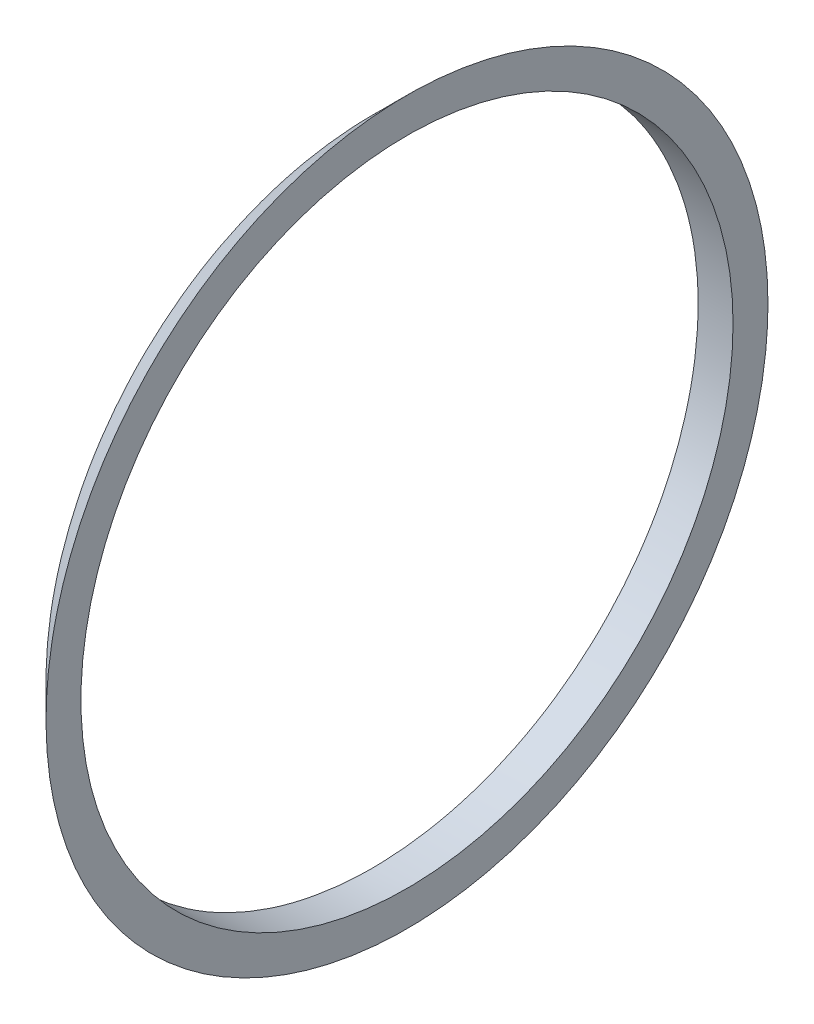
ISO-10303-21;
HEADER;
FILE_DESCRIPTION(('STEP AP214'),'2;1');
FILE_NAME('part.step','',(''),(''),'','','');
FILE_SCHEMA(('AUTOMOTIVE_DESIGN { 1 0 10303 214 1 1 1 1 }'));
ENDSEC;
DATA;
#1=APPLICATION_CONTEXT('core data for automotive mechanical design processes');
#2=APPLICATION_PROTOCOL_DEFINITION('international standard','automotive_design',2000,#1);
#3=PRODUCT_CONTEXT('',#1,'mechanical');
#4=PRODUCT('Part','Part','',(#3));
#5=PRODUCT_RELATED_PRODUCT_CATEGORY('part','',(#4));
#6=PRODUCT_DEFINITION_FORMATION('','',#4);
#7=PRODUCT_DEFINITION_CONTEXT('part definition',#1,'design');
#8=PRODUCT_DEFINITION('design','',#6,#7);
#9=PRODUCT_DEFINITION_SHAPE('','',#8);
#10=(LENGTH_UNIT() NAMED_UNIT(*) SI_UNIT(.MILLI.,.METRE.));
#11=(NAMED_UNIT(*) PLANE_ANGLE_UNIT() SI_UNIT($,.RADIAN.));
#12=(NAMED_UNIT(*) SI_UNIT($,.STERADIAN.) SOLID_ANGLE_UNIT());
#13=UNCERTAINTY_MEASURE_WITH_UNIT(LENGTH_MEASURE(1.E-05),#10,'distance_accuracy_value','');
#14=(GEOMETRIC_REPRESENTATION_CONTEXT(3) GLOBAL_UNCERTAINTY_ASSIGNED_CONTEXT((#13)) GLOBAL_UNIT_ASSIGNED_CONTEXT((#10,
#11,#12)) REPRESENTATION_CONTEXT('',''));
#15=CARTESIAN_POINT('',(0.,0.,0.));
#16=DIRECTION('',(0.,0.,1.));
#17=DIRECTION('',(1.,0.,0.));
#18=AXIS2_PLACEMENT_3D('',#15,#16,#17);
#19=CARTESIAN_POINT('',(-52.2996989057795,-11.5150179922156,0.));
#20=DIRECTION('',(-1.,0.,0.));
#21=DIRECTION('',(0.,0.,1.));
#22=AXIS2_PLACEMENT_3D('',#19,#20,#21);
#23=CYLINDRICAL_SURFACE('',#22,70.);
#24=CARTESIAN_POINT('',(-9.29969890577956,-11.5150179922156,0.));
#25=DIRECTION('',(1.,0.,0.));
#26=DIRECTION('',(0.,0.,-1.));
#27=AXIS2_PLACEMENT_3D('',#24,#25,#26);
#28=CIRCLE('',#27,70.);
#29=CARTESIAN_POINT('',(-9.29969890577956,-11.5150179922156,-70.));
#30=VERTEX_POINT('',#29);
#31=EDGE_CURVE('E72',#30,#30,#28,.F.);
#32=ORIENTED_EDGE('',*,*,#31,.F.);
#33=EDGE_LOOP('',(#32));
#34=FACE_BOUND('',#33,.T.);
#35=CARTESIAN_POINT('',(-16.7996989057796,-11.5150179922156,-70.));
#36=CARTESIAN_POINT('',(-16.7996951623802,-12.4159455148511,-70.0000030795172));
#37=CARTESIAN_POINT('',(-16.7995312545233,-13.3168025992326,-69.9826072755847));
#38=CARTESIAN_POINT('',(-16.7991683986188,-15.1171597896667,-69.9130594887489));
#39=CARTESIAN_POINT('',(-16.7989694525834,-16.0166599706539,-69.8609095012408));
#40=CARTESIAN_POINT('',(-16.7987199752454,-17.8130628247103,-69.7219216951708));
#41=CARTESIAN_POINT('',(-16.7986694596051,-18.7099652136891,-69.6350802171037));
#42=CARTESIAN_POINT('',(-16.7987659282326,-20.4997435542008,-69.4268419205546));
#43=CARTESIAN_POINT('',(-16.7989129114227,-21.3926195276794,-69.3054452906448));
#44=CARTESIAN_POINT('',(-16.7993331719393,-23.1733375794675,-69.0282241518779));
#45=CARTESIAN_POINT('',(-16.7996064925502,-24.0611778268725,-68.8723878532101));
#46=CARTESIAN_POINT('',(-16.8000439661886,-25.8301310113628,-68.5265641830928));
#47=CARTESIAN_POINT('',(-16.8002081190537,-26.711243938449,-68.3365767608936));
#48=CARTESIAN_POINT('',(-16.8004843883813,-29.3425114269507,-67.7157817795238));
#49=CARTESIAN_POINT('',(-16.8003804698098,-31.0809568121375,-67.2340850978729));
#50=CARTESIAN_POINT('',(-16.7999314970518,-34.5148986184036,-66.1381422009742));
#51=CARTESIAN_POINT('',(-16.7995864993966,-36.2104050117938,-65.5239270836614));
#52=CARTESIAN_POINT('',(-16.7995234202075,-39.5489679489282,-64.1665391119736));
#53=CARTESIAN_POINT('',(-16.7998053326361,-41.192024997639,-63.4233674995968));
#54=CARTESIAN_POINT('',(-16.8002709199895,-44.4162238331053,-61.8122794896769));
#55=CARTESIAN_POINT('',(-16.8004545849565,-45.9973593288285,-60.9443504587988));
#56=CARTESIAN_POINT('',(-16.8003269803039,-48.3150081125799,-59.5531153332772));
#57=CARTESIAN_POINT('',(-16.8002172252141,-49.0786350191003,-59.074418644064));
#58=CARTESIAN_POINT('',(-16.7998460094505,-50.5868896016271,-58.0878700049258));
#59=CARTESIAN_POINT('',(-16.7995845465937,-51.3315170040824,-57.5800176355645));
#60=CARTESIAN_POINT('',(-16.7990962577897,-52.8680006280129,-56.4880414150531));
#61=CARTESIAN_POINT('',(-16.7988748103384,-53.6579222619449,-55.9011946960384));
#62=CARTESIAN_POINT('',(-16.7986666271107,-55.2123380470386,-54.6947179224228));
#63=CARTESIAN_POINT('',(-16.7986798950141,-55.9768317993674,-54.0750873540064));
#64=CARTESIAN_POINT('',(-16.7989039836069,-57.479061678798,-52.8041168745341));
#65=CARTESIAN_POINT('',(-16.7991148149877,-58.2167963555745,-52.1527752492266));
#66=CARTESIAN_POINT('',(-16.7995157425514,-59.6641527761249,-50.8195718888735));
#67=CARTESIAN_POINT('',(-16.7997058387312,-60.3737745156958,-50.1377101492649));
#68=CARTESIAN_POINT('',(-16.7996910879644,-61.7637943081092,-48.7445275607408));
#69=CARTESIAN_POINT('',(-16.7994861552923,-62.4441859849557,-48.0332003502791));
#70=CARTESIAN_POINT('',(-16.7990787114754,-63.774372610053,-46.5824896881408));
#71=CARTESIAN_POINT('',(-16.7988762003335,-64.4241675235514,-45.843106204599));
#72=CARTESIAN_POINT('',(-16.7986729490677,-65.6919940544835,-44.337610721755));
#73=CARTESIAN_POINT('',(-16.7986722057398,-66.3100261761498,-43.5714991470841));
#74=CARTESIAN_POINT('',(-16.798904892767,-67.5132387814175,-42.0138992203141));
#75=CARTESIAN_POINT('',(-16.7991383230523,-68.0984192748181,-41.2224108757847));
#76=CARTESIAN_POINT('',(-16.7996495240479,-69.2348358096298,-39.6155387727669));
#77=CARTESIAN_POINT('',(-16.7999272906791,-69.7860749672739,-38.8001572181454));
#78=CARTESIAN_POINT('',(-16.8002909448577,-70.8536871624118,-37.1468790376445));
#79=CARTESIAN_POINT('',(-16.8003768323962,-71.3700601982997,-36.3089824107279));
#80=CARTESIAN_POINT('',(-16.800407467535,-72.3670236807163,-34.6121610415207));
#81=CARTESIAN_POINT('',(-16.800352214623,-72.8476139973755,-33.7532362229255));
#82=CARTESIAN_POINT('',(-16.8001564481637,-73.77215536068,-32.0158887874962));
#83=CARTESIAN_POINT('',(-16.8000159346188,-74.2161064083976,-31.1374661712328));
#84=CARTESIAN_POINT('',(-16.799744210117,-75.0665595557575,-29.3627274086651));
#85=CARTESIAN_POINT('',(-16.7996129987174,-75.4730634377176,-28.4664121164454));
#86=CARTESIAN_POINT('',(-16.7995277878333,-76.2479232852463,-26.6574411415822));
#87=CARTESIAN_POINT('',(-16.7995737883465,-76.6162792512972,-25.7447854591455));
#88=CARTESIAN_POINT('',(-16.7997705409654,-77.3141879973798,-23.9047572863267));
#89=CARTESIAN_POINT('',(-16.7999212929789,-77.643740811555,-22.977384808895));
#90=CARTESIAN_POINT('',(-16.8001858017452,-78.2634576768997,-21.1095711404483));
#91=CARTESIAN_POINT('',(-16.8002995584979,-78.5536217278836,-20.1691299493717));
#92=CARTESIAN_POINT('',(-16.8004130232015,-79.0940508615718,-18.2768310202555));
#93=CARTESIAN_POINT('',(-16.8004127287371,-79.344315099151,-17.3249730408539));
#94=CARTESIAN_POINT('',(-16.8002435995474,-79.8044921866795,-15.411552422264));
#95=CARTESIAN_POINT('',(-16.80007476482,-80.0144050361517,-14.449989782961));
#96=CARTESIAN_POINT('',(-16.7996028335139,-80.3935061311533,-12.5188702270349));
#97=CARTESIAN_POINT('',(-16.799299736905,-80.5626943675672,-11.5493133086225));
#98=CARTESIAN_POINT('',(-16.7988584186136,-80.8600453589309,-9.60392641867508));
#99=CARTESIAN_POINT('',(-16.7987201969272,-80.9882081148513,-8.62809644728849));
#100=CARTESIAN_POINT('',(-16.7986826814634,-81.2032808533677,-6.67190366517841));
#101=CARTESIAN_POINT('',(-16.7987833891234,-81.2901905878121,-5.69154082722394));
#102=CARTESIAN_POINT('',(-16.7991221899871,-81.4226017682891,-3.72799060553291));
#103=CARTESIAN_POINT('',(-16.7993602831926,-81.468103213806,-2.74480322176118));
#104=CARTESIAN_POINT('',(-16.7996111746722,-81.5052387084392,-1.26930175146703));
#105=CARTESIAN_POINT('',(-16.7996770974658,-81.5124308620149,-0.7773341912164));
#106=CARTESIAN_POINT('',(-16.7997096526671,-81.5164419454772,0.206643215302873));
#107=CARTESIAN_POINT('',(-16.7996762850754,-81.5132608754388,0.698653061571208));
#108=CARTESIAN_POINT('',(-16.7994889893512,-81.4881558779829,2.17440822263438));
#109=CARTESIAN_POINT('',(-16.7992478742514,-81.4506715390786,3.15793385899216));
#110=CARTESIAN_POINT('',(-16.7988669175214,-81.3342730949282,5.12249537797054));
#111=CARTESIAN_POINT('',(-16.7987270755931,-81.2553591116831,6.10353126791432));
#112=CARTESIAN_POINT('',(-16.7986785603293,-81.0562419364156,8.06141255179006));
#113=CARTESIAN_POINT('',(-16.7987698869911,-80.936038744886,9.03825794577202));
#114=CARTESIAN_POINT('',(-16.7991516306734,-80.6545568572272,10.9860102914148));
#115=CARTESIAN_POINT('',(-16.7994420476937,-80.4932781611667,11.9569172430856));
#116=CARTESIAN_POINT('',(-16.7999425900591,-80.1299320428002,13.8910692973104));
#117=CARTESIAN_POINT('',(-16.8001527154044,-79.9278646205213,14.8543143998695));
#118=CARTESIAN_POINT('',(-16.8003900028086,-79.4833002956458,16.7714294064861));
#119=CARTESIAN_POINT('',(-16.8004171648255,-79.2408033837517,17.7252993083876));
#120=CARTESIAN_POINT('',(-16.8003477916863,-78.7158113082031,19.6219677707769));
#121=CARTESIAN_POINT('',(-16.8002512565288,-78.4333161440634,20.5647663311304));
#122=CARTESIAN_POINT('',(-16.8000040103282,-77.8288431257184,22.4375745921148));
#123=CARTESIAN_POINT('',(-16.7998533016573,-77.5068670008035,23.3675848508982));
#124=CARTESIAN_POINT('',(-16.7996196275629,-76.8239648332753,25.2132859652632));
#125=CARTESIAN_POINT('',(-16.7995366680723,-76.4630353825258,26.1289755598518));
#126=CARTESIAN_POINT('',(-16.7995643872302,-75.7029081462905,27.9442838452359));
#127=CARTESIAN_POINT('',(-16.7996750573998,-75.3037120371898,28.8439032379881));
#128=CARTESIAN_POINT('',(-16.7999329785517,-74.4677480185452,30.6255126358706));
#129=CARTESIAN_POINT('',(-16.800080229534,-74.0309801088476,31.5075026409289));
#130=CARTESIAN_POINT('',(-16.8003051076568,-73.1206291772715,33.2523231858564));
#131=CARTESIAN_POINT('',(-16.8003827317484,-72.6470445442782,34.1151528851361));
#132=CARTESIAN_POINT('',(-16.8004059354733,-71.6639621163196,35.820003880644));
#133=CARTESIAN_POINT('',(-16.8003515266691,-71.1544674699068,36.6620269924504));
#134=CARTESIAN_POINT('',(-16.8000507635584,-70.100411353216,38.3238819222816));
#135=CARTESIAN_POINT('',(-16.7998044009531,-69.5558483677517,39.1437127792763));
#136=CARTESIAN_POINT('',(-16.7992906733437,-68.4326436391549,40.7596875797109));
#137=CARTESIAN_POINT('',(-16.7990233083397,-67.8540018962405,41.5558315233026));
#138=CARTESIAN_POINT('',(-16.7987102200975,-66.6636685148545,43.123016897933));
#139=CARTESIAN_POINT('',(-16.7986644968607,-66.051976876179,43.894058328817));
#140=CARTESIAN_POINT('',(-16.7987888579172,-64.7966314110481,45.4096676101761));
#141=CARTESIAN_POINT('',(-16.798958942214,-64.1529775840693,46.1542354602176));
#142=CARTESIAN_POINT('',(-16.7993704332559,-62.8348521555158,47.6155737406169));
#143=CARTESIAN_POINT('',(-16.7996118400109,-62.1603805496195,48.3323441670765));
#144=CARTESIAN_POINT('',(-16.7997310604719,-60.7818189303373,49.7368129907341));
#145=CARTESIAN_POINT('',(-16.7996088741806,-60.0777289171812,50.4245113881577));
#146=CARTESIAN_POINT('',(-16.7992501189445,-58.6411824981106,51.7696132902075));
#147=CARTESIAN_POINT('',(-16.7990135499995,-57.9087260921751,52.4270167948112));
#148=CARTESIAN_POINT('',(-16.7987194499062,-56.4167492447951,53.7103600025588));
#149=CARTESIAN_POINT('',(-16.7986619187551,-55.6572288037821,54.3362997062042));
#150=CARTESIAN_POINT('',(-16.7987845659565,-54.1125188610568,55.5555672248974));
#151=CARTESIAN_POINT('',(-16.7989647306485,-53.3273308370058,56.1488969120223));
#152=CARTESIAN_POINT('',(-16.7994463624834,-51.7325481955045,57.3019948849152));
#153=CARTESIAN_POINT('',(-16.7997478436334,-50.9229507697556,57.8617592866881));
#154=CARTESIAN_POINT('',(-16.800180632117,-49.2808756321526,58.9466568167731));
#155=CARTESIAN_POINT('',(-16.8003119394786,-48.4483979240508,59.4717899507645));
#156=CARTESIAN_POINT('',(-16.8004192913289,-46.7621396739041,60.4864327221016));
#157=CARTESIAN_POINT('',(-16.800395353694,-45.9083615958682,60.9759464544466));
#158=CARTESIAN_POINT('',(-16.8002443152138,-44.1808786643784,61.9185738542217));
#159=CARTESIAN_POINT('',(-16.800117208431,-43.3071726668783,62.3716854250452));
#160=CARTESIAN_POINT('',(-16.7998438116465,-41.5414349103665,63.2406714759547));
#161=CARTESIAN_POINT('',(-16.7996975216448,-40.6494031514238,63.6565459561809));
#162=CARTESIAN_POINT('',(-16.7995441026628,-38.8485999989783,64.4503183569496));
#163=CARTESIAN_POINT('',(-16.799536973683,-37.9398286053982,64.8282162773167));
#164=CARTESIAN_POINT('',(-16.7996732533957,-36.1071621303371,65.5453635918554));
#165=CARTESIAN_POINT('',(-16.7998166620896,-35.1832670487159,65.8846129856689));
#166=CARTESIAN_POINT('',(-16.8000912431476,-33.3219959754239,66.5238600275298));
#167=CARTESIAN_POINT('',(-16.8002224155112,-32.3846199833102,66.8238576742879));
#168=CARTESIAN_POINT('',(-16.8003860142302,-30.4980541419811,67.3840676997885));
#169=CARTESIAN_POINT('',(-16.8004184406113,-29.5488642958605,67.644280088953));
#170=CARTESIAN_POINT('',(-16.8003321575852,-27.6403581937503,68.1244570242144));
#171=CARTESIAN_POINT('',(-16.8002134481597,-26.6810419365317,68.3444215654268));
#172=CARTESIAN_POINT('',(-16.7997973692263,-24.7539889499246,68.743711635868));
#173=CARTESIAN_POINT('',(-16.7994999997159,-23.7862522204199,68.9230371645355));
#174=CARTESIAN_POINT('',(-16.7990076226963,-21.8440789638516,69.2407303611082));
#175=CARTESIAN_POINT('',(-16.7988126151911,-20.8696424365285,69.3790980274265));
#176=CARTESIAN_POINT('',(-16.7986604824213,-18.91580231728,69.6146294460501));
#177=CARTESIAN_POINT('',(-16.798703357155,-17.93639872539,69.7117931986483));
#178=CARTESIAN_POINT('',(-16.798974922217,-15.9743660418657,69.8647440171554));
#179=CARTESIAN_POINT('',(-16.7992036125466,-14.9917369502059,69.9205310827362));
#180=CARTESIAN_POINT('',(-16.7995797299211,-13.0250004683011,69.9906293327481));
#181=CARTESIAN_POINT('',(-16.7997271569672,-12.0408930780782,70.0049405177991));
#182=CARTESIAN_POINT('',(-16.7996427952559,-10.0729498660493,69.9920615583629));
#183=CARTESIAN_POINT('',(-16.7994110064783,-9.0891140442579,69.9648714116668));
#184=CARTESIAN_POINT('',(-16.7989977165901,-7.12346339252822,69.8690381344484));
#185=CARTESIAN_POINT('',(-16.7988162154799,-6.14164856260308,69.8003950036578));
#186=CARTESIAN_POINT('',(-16.7986645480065,-4.18178568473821,69.6217778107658));
#187=CARTESIAN_POINT('',(-16.7986943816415,-3.20373763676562,69.5118037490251));
#188=CARTESIAN_POINT('',(-16.7989810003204,-1.25314747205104,69.2507202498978));
#189=CARTESIAN_POINT('',(-16.7992377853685,-0.280605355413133,69.0996108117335));
#190=CARTESIAN_POINT('',(-16.799752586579,1.65724283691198,68.7565253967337));
#191=CARTESIAN_POINT('',(-16.8000106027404,2.62254891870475,68.5645494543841));
#192=CARTESIAN_POINT('',(-16.8003333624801,4.5442094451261,68.1400723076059));
#193=CARTESIAN_POINT('',(-16.8003981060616,5.50056388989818,67.907571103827));
#194=CARTESIAN_POINT('',(-16.8003925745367,7.40262059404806,67.4024568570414));
#195=CARTESIAN_POINT('',(-16.8003222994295,8.34832285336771,67.1298438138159));
#196=CARTESIAN_POINT('',(-16.8001067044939,10.2273935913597,66.5449906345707));
#197=CARTESIAN_POINT('',(-16.7999613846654,11.1607620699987,66.2327504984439));
#198=CARTESIAN_POINT('',(-16.7996974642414,13.0135055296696,65.5691983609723));
#199=CARTESIAN_POINT('',(-16.7995788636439,13.9328805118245,65.2178863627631));
#200=CARTESIAN_POINT('',(-16.799531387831,15.7560022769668,64.476815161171));
#201=CARTESIAN_POINT('',(-16.7996025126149,16.6597490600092,64.0870559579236));
#202=CARTESIAN_POINT('',(-16.7998248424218,18.4500074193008,63.2697834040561));
#203=CARTESIAN_POINT('',(-16.7999760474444,19.3365189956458,62.8422700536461));
#204=CARTESIAN_POINT('',(-16.8002299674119,21.0907306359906,61.9502493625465));
#205=CARTESIAN_POINT('',(-16.8003326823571,21.9584307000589,61.4857420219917));
#206=CARTESIAN_POINT('',(-16.8004175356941,23.6734769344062,60.5205590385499));
#207=CARTESIAN_POINT('',(-16.8003996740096,24.5208230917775,60.0198833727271));
#208=CARTESIAN_POINT('',(-16.8001855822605,26.1936543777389,58.9832541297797));
#209=CARTESIAN_POINT('',(-16.799989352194,27.0191395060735,58.4473005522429));
#210=CARTESIAN_POINT('',(-16.7994968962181,28.6467803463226,57.3410690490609));
#211=CARTESIAN_POINT('',(-16.7992006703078,29.4489360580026,56.7707911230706));
#212=CARTESIAN_POINT('',(-16.7987970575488,31.028493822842,55.5969228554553));
#213=CARTESIAN_POINT('',(-16.7986896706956,31.8058958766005,54.9933325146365));
#214=CARTESIAN_POINT('',(-16.7987094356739,33.3345564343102,53.7539202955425));
#215=CARTESIAN_POINT('',(-16.7988365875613,34.0858149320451,53.1180984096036));
#216=CARTESIAN_POINT('',(-16.7992047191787,35.5608811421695,51.8153249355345));
#217=CARTESIAN_POINT('',(-16.7994456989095,36.2846888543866,51.1483733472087));
#218=CARTESIAN_POINT('',(-16.7996577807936,37.3487861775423,50.1255500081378));
#219=CARTESIAN_POINT('',(-16.7997035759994,37.699892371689,49.7808663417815));
#220=CARTESIAN_POINT('',(-16.7996930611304,38.3947601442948,49.0841736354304));
#221=CARTESIAN_POINT('',(-16.7996367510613,38.7385217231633,48.7321645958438));
#222=CARTESIAN_POINT('',(-16.7994041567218,39.7585505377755,47.6653883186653));
#223=CARTESIAN_POINT('',(-16.7991642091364,40.4236012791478,46.939834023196));
#224=CARTESIAN_POINT('',(-16.7988096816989,41.7225020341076,45.4613549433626));
#225=CARTESIAN_POINT('',(-16.7986951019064,42.3563520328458,44.7084301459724));
#226=CARTESIAN_POINT('',(-16.7987031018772,43.5917501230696,43.1765253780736));
#227=CARTESIAN_POINT('',(-16.7988256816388,44.1932982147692,42.3975454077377));
#228=CARTESIAN_POINT('',(-16.7992482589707,45.363024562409,40.8149045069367));
#229=CARTESIAN_POINT('',(-16.7995482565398,45.9312028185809,40.0112435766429));
#230=CARTESIAN_POINT('',(-16.8000324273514,47.0331460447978,38.3807374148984));
#231=CARTESIAN_POINT('',(-16.8002166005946,47.5669110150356,37.5538921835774));
#232=CARTESIAN_POINT('',(-16.8004994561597,49.1151288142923,35.0407691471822));
#233=CARTESIAN_POINT('',(-16.8003286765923,50.0767660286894,33.3215500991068));
#234=CARTESIAN_POINT('',(-16.7998296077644,51.8517359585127,29.8081876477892));
#235=CARTESIAN_POINT('',(-16.7995013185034,52.6650686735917,28.0140442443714));
#236=CARTESIAN_POINT('',(-16.7995916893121,53.7694252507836,25.2766814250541));
#237=CARTESIAN_POINT('',(-16.7997189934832,54.1183026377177,24.3564312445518));
#238=CARTESIAN_POINT('',(-16.7999888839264,54.7769767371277,22.501984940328));
#239=CARTESIAN_POINT('',(-16.8001314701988,55.086773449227,21.5677888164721));
#240=CARTESIAN_POINT('',(-16.8003372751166,55.6667006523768,19.6871797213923));
#241=CARTESIAN_POINT('',(-16.8004004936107,55.9368310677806,18.7407667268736));
#242=CARTESIAN_POINT('',(-16.8003888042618,56.436953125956,16.8373934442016));
#243=CARTESIAN_POINT('',(-16.8003138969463,56.6669449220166,15.8804331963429));
#244=CARTESIAN_POINT('',(-16.7999708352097,57.0863801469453,13.9576655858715));
#245=CARTESIAN_POINT('',(-16.7997026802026,57.275823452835,12.9918581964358));
#246=CARTESIAN_POINT('',(-16.799188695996,57.6138246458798,11.0531151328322));
#247=CARTESIAN_POINT('',(-16.7989428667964,57.7623825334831,10.0801794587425));
#248=CARTESIAN_POINT('',(-16.79868215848,58.0183485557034,8.12891015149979));
#249=CARTESIAN_POINT('',(-16.7986672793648,58.1257566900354,7.15057651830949));
#250=CARTESIAN_POINT('',(-16.7988443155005,58.2992322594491,5.19025087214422));
#251=CARTESIAN_POINT('',(-16.7990362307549,58.3652996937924,4.20825885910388));
#252=CARTESIAN_POINT('',(-16.7994482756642,58.4559763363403,2.24236342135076));
#253=CARTESIAN_POINT('',(-16.7996684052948,58.4805855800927,1.2584599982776));
#254=CARTESIAN_POINT('',(-16.7997191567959,58.4883021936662,-0.709509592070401));
#255=CARTESIAN_POINT('',(-16.7995497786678,58.4714095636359,-1.69357575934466));
#256=CARTESIAN_POINT('',(-16.7991600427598,58.3961524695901,-3.66012099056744));
#257=CARTESIAN_POINT('',(-16.79893968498,58.3377880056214,-4.64260005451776));
#258=CARTESIAN_POINT('',(-16.7986905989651,58.1796910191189,-6.60422415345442));
#259=CARTESIAN_POINT('',(-16.7986618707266,58.0799584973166,-7.58336918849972));
#260=CARTESIAN_POINT('',(-16.798841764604,57.8393096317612,-9.53652819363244));
#261=CARTESIAN_POINT('',(-16.7990503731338,57.6983956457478,-10.5105424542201));
#262=CARTESIAN_POINT('',(-16.799550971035,57.3756135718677,-12.4518768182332));
#263=CARTESIAN_POINT('',(-16.7998429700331,57.1937407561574,-13.4191961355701));
#264=CARTESIAN_POINT('',(-16.8002421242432,56.7893853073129,-15.345251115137));
#265=CARTESIAN_POINT('',(-16.8003492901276,56.566905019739,-16.3039872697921));
#266=CARTESIAN_POINT('',(-16.8004161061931,56.0817232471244,-18.2112277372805));
#267=CARTESIAN_POINT('',(-16.8003757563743,55.8190217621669,-19.1597320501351));
#268=CARTESIAN_POINT('',(-16.8002007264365,55.2538621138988,-21.04483093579));
#269=CARTESIAN_POINT('',(-16.8000660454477,54.9514035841,-21.9814253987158));
#270=CARTESIAN_POINT('',(-16.7997913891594,54.3072695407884,-23.841030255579));
#271=CARTESIAN_POINT('',(-16.7996514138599,53.9655940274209,-24.7640406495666));
#272=CARTESIAN_POINT('',(-16.7995320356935,53.2436335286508,-26.5948362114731));
#273=CARTESIAN_POINT('',(-16.7995526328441,52.8633485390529,-27.5026213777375));
#274=CARTESIAN_POINT('',(-16.7997216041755,52.064845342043,-29.3013521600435));
#275=CARTESIAN_POINT('',(-16.7998699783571,51.6466271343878,-30.1922977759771));
#276=CARTESIAN_POINT('',(-16.8001412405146,50.7730092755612,-31.9557488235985));
#277=CARTESIAN_POINT('',(-16.8002641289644,50.3176103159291,-32.8282545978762));
#278=CARTESIAN_POINT('',(-16.8004027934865,49.3704341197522,-34.5532913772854));
#279=CARTESIAN_POINT('',(-16.8004185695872,48.8786568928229,-35.4058223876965));
#280=CARTESIAN_POINT('',(-16.8002906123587,47.8595985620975,-37.0893937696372));
#281=CARTESIAN_POINT('',(-16.8001468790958,47.3323174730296,-37.9204341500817));
#282=CARTESIAN_POINT('',(-16.7996996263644,46.2431893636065,-39.5595463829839));
#283=CARTESIAN_POINT('',(-16.7993961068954,45.6813423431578,-40.3676182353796));
#284=CARTESIAN_POINT('',(-16.7989260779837,44.5241108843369,-41.9593152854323));
#285=CARTESIAN_POINT('',(-16.7987595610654,43.9287282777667,-42.7429418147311));
#286=CARTESIAN_POINT('',(-16.7986670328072,42.7054639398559,-44.2843932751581));
#287=CARTESIAN_POINT('',(-16.7987410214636,42.0775822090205,-45.0422182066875));
#288=CARTESIAN_POINT('',(-16.7990474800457,40.7904060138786,-46.5307497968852));
#289=CARTESIAN_POINT('',(-16.7992799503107,40.1311114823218,-47.2614563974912));
#290=CARTESIAN_POINT('',(-16.7995562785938,39.119551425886,-48.3361404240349));
#291=CARTESIAN_POINT('',(-16.7996363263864,38.7785852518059,-48.6908153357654));
#292=CARTESIAN_POINT('',(-16.7997082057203,38.0892518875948,-49.3928986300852));
#293=CARTESIAN_POINT('',(-16.799700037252,37.7408846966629,-49.7403070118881));
#294=CARTESIAN_POINT('',(-16.7995648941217,36.6848264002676,-50.7714802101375));
#295=CARTESIAN_POINT('',(-16.7993272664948,35.9662287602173,-51.4441397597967));
#296=CARTESIAN_POINT('',(-16.7989279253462,34.5013353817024,-52.7585414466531));
#297=CARTESIAN_POINT('',(-16.798766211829,33.7550396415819,-53.4002835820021));
#298=CARTESIAN_POINT('',(-16.7986661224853,32.2360553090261,-54.6517328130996));
#299=CARTESIAN_POINT('',(-16.7987277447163,31.4633669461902,-55.2614401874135));
#300=CARTESIAN_POINT('',(-16.7990655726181,29.8929731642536,-56.4477336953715));
#301=CARTESIAN_POINT('',(-16.7993417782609,29.0952677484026,-57.0243198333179));
#302=CARTESIAN_POINT('',(-16.7998526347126,27.4760654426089,-58.1434795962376));
#303=CARTESIAN_POINT('',(-16.8000872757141,26.6545629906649,-58.6860451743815));
#304=CARTESIAN_POINT('',(-16.8003667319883,24.9894078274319,-59.7360503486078));
#305=CARTESIAN_POINT('',(-16.8004115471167,24.145755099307,-60.2434899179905));
#306=CARTESIAN_POINT('',(-16.8003719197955,22.4377696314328,-61.2223578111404));
#307=CARTESIAN_POINT('',(-16.8002874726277,21.5734361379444,-61.6937848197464));
#308=CARTESIAN_POINT('',(-16.8000542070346,19.8256568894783,-62.5997682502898));
#309=CARTESIAN_POINT('',(-16.7999053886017,18.9422111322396,-63.0343246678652));
#310=CARTESIAN_POINT('',(-16.7996545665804,17.1582945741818,-63.8655533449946));
#311=CARTESIAN_POINT('',(-16.7995525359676,16.2578339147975,-64.2622473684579));
#312=CARTESIAN_POINT('',(-16.7995441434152,14.440986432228,-65.0173333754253));
#313=CARTESIAN_POINT('',(-16.799637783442,13.5245994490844,-65.3757249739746));
#314=CARTESIAN_POINT('',(-16.7998804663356,11.6776466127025,-66.0535220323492));
#315=CARTESIAN_POINT('',(-16.800029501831,10.7470826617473,-66.3729326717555));
#316=CARTESIAN_POINT('',(-16.8002716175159,8.87339540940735,-66.9722346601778));
#317=CARTESIAN_POINT('',(-16.800364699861,7.93027259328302,-67.2521275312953));
#318=CARTESIAN_POINT('',(-16.8004248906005,5.4769968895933,-67.9242553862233));
#319=CARTESIAN_POINT('',(-16.8002862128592,3.95843194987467,-68.2862075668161));
#320=CARTESIAN_POINT('',(-16.7996115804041,0.900813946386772,-68.907771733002));
#321=CARTESIAN_POINT('',(-16.7990756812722,-0.638236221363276,-69.1673980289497));
#322=CARTESIAN_POINT('',(-16.7986126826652,-3.72999426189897,-69.5832308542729));
#323=CARTESIAN_POINT('',(-16.7986854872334,-5.28269994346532,-69.7394536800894));
#324=CARTESIAN_POINT('',(-16.7992318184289,-8.39534629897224,-69.9478409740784));
#325=CARTESIAN_POINT('',(-16.7997053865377,-9.95528770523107,-69.9999946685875));
#326=CARTESIAN_POINT('',(-16.7996989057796,-11.5150179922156,-70.));
#327=B_SPLINE_CURVE_WITH_KNOTS('',3,(#35,#36,#37,#38,#39,#40,#41,#42,#43,#44,#45,#46,#47,#48,
#49,#50,#51,#52,#53,#54,#55,#56,#57,#58,#59,#60,#61,#62,#63,#64,#65,#66,#67,#68,#69,#70,#71,#72,
#73,#74,#75,#76,#77,#78,#79,#80,#81,#82,#83,#84,#85,#86,#87,#88,#89,#90,#91,#92,#93,#94,#95,#96,
#97,#98,#99,#100,#101,#102,#103,#104,#105,#106,#107,#108,#109,#110,#111,#112,#113,#114,#115,
#116,#117,#118,#119,#120,#121,#122,#123,#124,#125,#126,#127,#128,#129,#130,#131,#132,#133,#134,
#135,#136,#137,#138,#139,#140,#141,#142,#143,#144,#145,#146,#147,#148,#149,#150,#151,#152,#153,
#154,#155,#156,#157,#158,#159,#160,#161,#162,#163,#164,#165,#166,#167,#168,#169,#170,#171,#172,
#173,#174,#175,#176,#177,#178,#179,#180,#181,#182,#183,#184,#185,#186,#187,#188,#189,#190,#191,
#192,#193,#194,#195,#196,#197,#198,#199,#200,#201,#202,#203,#204,#205,#206,#207,#208,#209,#210,
#211,#212,#213,#214,#215,#216,#217,#218,#219,#220,#221,#222,#223,#224,#225,#226,#227,#228,#229,
#230,#231,#232,#233,#234,#235,#236,#237,#238,#239,#240,#241,#242,#243,#244,#245,#246,#247,#248,
#249,#250,#251,#252,#253,#254,#255,#256,#257,#258,#259,#260,#261,#262,#263,#264,#265,#266,#267,
#268,#269,#270,#271,#272,#273,#274,#275,#276,#277,#278,#279,#280,#281,#282,#283,#284,#285,#286,
#287,#288,#289,#290,#291,#292,#293,#294,#295,#296,#297,#298,#299,#300,#301,#302,#303,#304,#305,
#306,#307,#308,#309,#310,#311,#312,#313,#314,#315,#316,#317,#318,#319,#320,#321,#322,#323,#324,
#325,#326),.UNSPECIFIED.,.T.,.F.,(4,2,2,2,2,2,2,2,2,2,2,2,2,2,2,2,2,2,2,2,2,2,2,2,2,2,2,2,2,2,2,
2,2,2,2,2,2,2,2,2,2,2,2,2,2,2,2,2,2,2,2,2,2,2,2,2,2,2,2,2,2,2,2,2,2,2,2,2,2,2,2,2,2,2,2,2,2,2,2,
2,2,2,2,2,2,2,2,2,2,2,2,2,2,2,2,2,2,2,2,2,2,2,2,2,2,2,2,2,2,2,2,2,2,2,2,2,2,2,2,2,2,2,2,2,2,2,2,
2,2,2,2,2,2,2,2,2,2,2,2,2,2,2,2,2,2,4),(0.,2.7024926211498,5.40483009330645,8.10745270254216,
10.8100605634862,13.5135950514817,16.2171335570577,21.6231140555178,27.0278273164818,
32.4324885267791,37.8376974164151,40.540936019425,43.2442135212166,46.1955019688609,
49.1468366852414,52.0983311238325,55.049826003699,58.0019614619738,60.9541002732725,
63.9061922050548,66.8582832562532,69.8101028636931,72.7619226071,75.7137530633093,
78.6655834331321,81.6172732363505,84.5689630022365,87.5206501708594,90.4723373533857,
93.4240870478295,96.375836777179,99.3275871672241,102.279337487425,105.231105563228,
108.18287367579,109.658839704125,111.134805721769,114.086573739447,117.038333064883,
119.990092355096,122.941851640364,125.893610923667,128.845370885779,131.7971308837,
134.748761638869,137.700650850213,140.6524108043,143.604170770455,146.556059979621,
149.507690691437,152.459449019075,155.41120732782,158.362965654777,161.314724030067,
164.266482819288,167.218241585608,170.170000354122,173.121759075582,176.073348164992,
179.025278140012,181.977207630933,184.928797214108,187.880556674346,190.832316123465,
193.784075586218,196.735835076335,199.687594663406,202.639353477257,205.591112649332,
208.542871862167,211.494631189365,214.446390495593,217.398149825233,220.349909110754,
223.301668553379,226.253428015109,229.205187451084,232.156946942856,235.108703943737,
238.060460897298,241.012217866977,243.963974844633,246.915731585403,249.867488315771,
252.81924502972,255.771001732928,258.722760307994,261.67451891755,264.62627755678,
267.578036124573,270.529795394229,273.481554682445,274.957516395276,276.433478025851,
279.385237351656,282.336998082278,285.288758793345,288.240519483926,291.192280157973,
297.094485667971,302.996691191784,305.948448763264,308.900206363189,311.851969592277,
314.803721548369,317.755482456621,320.70724333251,323.659004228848,326.610765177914,
329.562523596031,332.514282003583,335.466040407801,338.417798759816,341.369388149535,
344.321318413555,347.273078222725,350.224838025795,353.176625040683,356.128412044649,
359.080199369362,362.031986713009,364.983719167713,367.935450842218,370.887181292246,
373.838911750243,376.790481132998,379.742050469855,382.693626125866,384.169495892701,
385.645365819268,388.597325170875,391.549284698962,394.501218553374,397.453152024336,
400.405781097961,403.358412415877,406.311151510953,409.263890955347,412.21492276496,
415.165984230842,418.116653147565,421.067208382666,425.746805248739,430.425747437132,
435.103952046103,439.782640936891),.UNSPECIFIED.);
#328=CARTESIAN_POINT('',(-16.7996989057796,-11.5150179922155,-70.));
#329=VERTEX_POINT('',#328);
#330=EDGE_CURVE('E62',#329,#329,#327,.T.);
#331=ORIENTED_EDGE('',*,*,#330,.T.);
#332=EDGE_LOOP('',(#331));
#333=FACE_BOUND('',#332,.T.);
#334=ADVANCED_FACE('F55',(#34,#333),#23,.F.);
#335=CARTESIAN_POINT('',(-9.29969890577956,53.4849820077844,0.));
#336=DIRECTION('',(1.,0.,0.));
#337=DIRECTION('',(0.,0.,-1.));
#338=AXIS2_PLACEMENT_3D('',#335,#336,#337);
#339=PLANE('',#338);
#340=CARTESIAN_POINT('',(-9.29969890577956,-11.5150179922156,-77.5));
#341=CARTESIAN_POINT('',(-9.29969890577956,-9.71780543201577,-77.5000026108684));
#342=CARTESIAN_POINT('',(-9.29969890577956,-7.92081415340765,-77.4369086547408));
#343=CARTESIAN_POINT('',(-9.29969890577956,-4.33554747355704,-77.1864972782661));
#344=CARTESIAN_POINT('',(-9.29969890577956,-2.54727144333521,-76.9991889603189));
#345=CARTESIAN_POINT('',(-9.29969890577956,1.01132317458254,-76.5014920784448));
#346=CARTESIAN_POINT('',(-9.29969890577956,2.78164834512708,-76.1911504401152));
#347=CARTESIAN_POINT('',(-9.29969890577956,6.2965184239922,-75.4476152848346));
#348=CARTESIAN_POINT('',(-9.29969890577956,8.04106315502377,-75.0144209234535));
#349=CARTESIAN_POINT('',(-9.29969890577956,10.6317169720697,-74.274384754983));
#350=CARTESIAN_POINT('',(-9.29969890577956,11.49096111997,-74.0126458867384));
#351=CARTESIAN_POINT('',(-9.29969890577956,13.1998620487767,-73.4594170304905));
#352=CARTESIAN_POINT('',(-9.29969890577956,14.0495188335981,-73.1679270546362));
#353=CARTESIAN_POINT('',(-9.29969890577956,15.7381737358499,-72.5556235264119));
#354=CARTESIAN_POINT('',(-9.29969890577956,16.5771719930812,-72.2348103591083));
#355=CARTESIAN_POINT('',(-9.29969890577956,18.243567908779,-71.5643392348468));
#356=CARTESIAN_POINT('',(-9.29969890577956,19.0709655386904,-71.2146812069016));
#357=CARTESIAN_POINT('',(-9.29969890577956,20.7135019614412,-70.4867421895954));
#358=CARTESIAN_POINT('',(-9.29969890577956,21.5286352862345,-70.1084488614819));
#359=CARTESIAN_POINT('',(-9.29969890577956,23.1452484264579,-69.3237481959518));
#360=CARTESIAN_POINT('',(-9.29969890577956,23.9467283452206,-68.9173410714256));
#361=CARTESIAN_POINT('',(-9.29969890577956,25.5351100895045,-68.0768133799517));
#362=CARTESIAN_POINT('',(-9.29969890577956,26.3220107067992,-67.6426905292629));
#363=CARTESIAN_POINT('',(-9.29969890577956,27.8802005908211,-66.747251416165));
#364=CARTESIAN_POINT('',(-9.29969890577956,28.6514894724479,-66.285934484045));
#365=CARTESIAN_POINT('',(-9.29969890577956,30.3390445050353,-65.2361345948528));
#366=CARTESIAN_POINT('',(-9.29969890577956,31.2514345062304,-64.641405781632));
#367=CARTESIAN_POINT('',(-9.29969890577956,33.0503064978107,-63.413937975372));
#368=CARTESIAN_POINT('',(-9.29969890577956,33.9367875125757,-62.7811975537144));
#369=CARTESIAN_POINT('',(-9.29969890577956,35.682540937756,-61.4790120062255));
#370=CARTESIAN_POINT('',(-9.29969890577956,36.5418100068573,-60.8095624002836));
#371=CARTESIAN_POINT('',(-9.29969890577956,38.2315231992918,-59.4352546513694));
#372=CARTESIAN_POINT('',(-9.29969890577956,39.0619675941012,-58.7303968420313));
#373=CARTESIAN_POINT('',(-9.29969890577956,40.6928862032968,-57.2860454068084));
#374=CARTESIAN_POINT('',(-9.29969890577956,41.4933468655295,-56.5465364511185));
#375=CARTESIAN_POINT('',(-9.29969890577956,42.6699438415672,-55.4123771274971));
#376=CARTESIAN_POINT('',(-9.29969890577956,43.0581369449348,-55.0301644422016));
#377=CARTESIAN_POINT('',(-9.29969890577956,43.8262985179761,-54.2575616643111));
#378=CARTESIAN_POINT('',(-9.29969890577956,44.2062669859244,-53.8671715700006));
#379=CARTESIAN_POINT('',(-9.29969890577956,45.3336126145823,-52.6841068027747));
#380=CARTESIAN_POINT('',(-9.29969890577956,46.0685035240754,-51.8794667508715));
#381=CARTESIAN_POINT('',(-9.29969890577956,47.5038008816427,-50.2400330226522));
#382=CARTESIAN_POINT('',(-9.29969890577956,48.2042069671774,-49.405239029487));
#383=CARTESIAN_POINT('',(-9.29969890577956,49.56968240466,-47.7066860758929));
#384=CARTESIAN_POINT('',(-9.29969890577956,50.2347378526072,-46.8429159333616));
#385=CARTESIAN_POINT('',(-9.29969890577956,51.5279748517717,-45.0882092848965));
#386=CARTESIAN_POINT('',(-9.29969890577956,52.1561567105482,-44.1972730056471));
#387=CARTESIAN_POINT('',(-9.29969890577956,53.3742715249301,-42.3896143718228));
#388=CARTESIAN_POINT('',(-9.29969890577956,53.964204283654,-41.4728918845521));
#389=CARTESIAN_POINT('',(-9.29969890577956,55.1047179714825,-39.6152847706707));
#390=CARTESIAN_POINT('',(-9.29969890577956,55.6552988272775,-38.674400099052));
#391=CARTESIAN_POINT('',(-9.29969890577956,56.7161075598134,-36.7703062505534));
#392=CARTESIAN_POINT('',(-9.29969890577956,57.2263404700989,-35.80709987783));
#393=CARTESIAN_POINT('',(-9.29969890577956,58.2056933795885,-33.8600074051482));
#394=CARTESIAN_POINT('',(-9.29969890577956,58.6748132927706,-32.8761212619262));
#395=CARTESIAN_POINT('',(-9.29969890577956,59.5712457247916,-30.8894828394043));
#396=CARTESIAN_POINT('',(-9.29969890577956,59.9985581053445,-29.886730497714));
#397=CARTESIAN_POINT('',(-9.29969890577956,60.810701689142,-27.8641673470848));
#398=CARTESIAN_POINT('',(-9.29969890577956,61.1955329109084,-26.8443565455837));
#399=CARTESIAN_POINT('',(-9.29969890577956,61.9218824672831,-24.7893511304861));
#400=CARTESIAN_POINT('',(-9.29969890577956,62.2633981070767,-23.7541555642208));
#401=CARTESIAN_POINT('',(-9.29969890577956,62.9023781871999,-21.6702572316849));
#402=CARTESIAN_POINT('',(-9.29969890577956,63.1998426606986,-20.6215544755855));
#403=CARTESIAN_POINT('',(-9.29969890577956,63.7501284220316,-18.5124991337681));
#404=CARTESIAN_POINT('',(-9.29969890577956,64.0029497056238,-17.4521465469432));
#405=CARTESIAN_POINT('',(-9.29969890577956,64.4634382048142,-15.3216824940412));
#406=CARTESIAN_POINT('',(-9.29969890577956,64.6711053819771,-14.2515710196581));
#407=CARTESIAN_POINT('',(-9.29969890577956,65.0411652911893,-12.1035331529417));
#408=CARTESIAN_POINT('',(-9.29969890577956,65.2035573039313,-11.0256066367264));
#409=CARTESIAN_POINT('',(-9.29969890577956,65.4829923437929,-8.8638932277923));
#410=CARTESIAN_POINT('',(-9.29969890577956,65.6000350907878,-7.78010629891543));
#411=CARTESIAN_POINT('',(-9.29969890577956,65.7885254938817,-5.60860994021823));
#412=CARTESIAN_POINT('',(-9.29969890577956,65.8599758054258,-4.52090074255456));
#413=CARTESIAN_POINT('',(-9.29969890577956,65.9569625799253,-2.3434169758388));
#414=CARTESIAN_POINT('',(-9.29969890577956,65.9824941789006,-1.25364220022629));
#415=CARTESIAN_POINT('',(-9.29969890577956,65.9894296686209,2.01415329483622));
#416=CARTESIAN_POINT('',(-9.29969890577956,65.9013704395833,4.1928909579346));
#417=CARTESIAN_POINT('',(-9.29969890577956,65.6327512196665,7.44877099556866));
#418=CARTESIAN_POINT('',(-9.29969890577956,65.5204359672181,8.53214857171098));
#419=CARTESIAN_POINT('',(-9.29969890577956,65.2504976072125,10.6933477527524));
#420=CARTESIAN_POINT('',(-9.29969890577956,65.0928747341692,11.7711693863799));
#421=CARTESIAN_POINT('',(-9.29969890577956,64.7324248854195,13.9191960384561));
#422=CARTESIAN_POINT('',(-9.29969890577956,64.5295981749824,14.9894011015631));
#423=CARTESIAN_POINT('',(-9.29969890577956,64.0788202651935,17.1202731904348));
#424=CARTESIAN_POINT('',(-9.29969890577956,63.8308691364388,18.180940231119));
#425=CARTESIAN_POINT('',(-9.29969890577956,63.290333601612,20.2908361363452));
#426=CARTESIAN_POINT('',(-9.29969890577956,62.9977491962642,21.3400650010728));
#427=CARTESIAN_POINT('',(-9.29969890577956,62.3685268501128,23.4252296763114));
#428=CARTESIAN_POINT('',(-9.29969890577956,62.0318888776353,24.4611654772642));
#429=CARTESIAN_POINT('',(-9.29969890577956,61.3152961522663,26.5178086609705));
#430=CARTESIAN_POINT('',(-9.29969890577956,60.9353463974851,27.538517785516));
#431=CARTESIAN_POINT('',(-9.29969890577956,60.1329437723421,29.5630894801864));
#432=CARTESIAN_POINT('',(-9.29969890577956,59.7104908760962,30.5669520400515));
#433=CARTESIAN_POINT('',(-9.29969890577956,58.8237800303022,32.5560395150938));
#434=CARTESIAN_POINT('',(-9.29969890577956,58.3595222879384,33.5412645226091));
#435=CARTESIAN_POINT('',(-9.29969890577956,57.3898794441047,35.4912553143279));
#436=CARTESIAN_POINT('',(-9.29969890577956,56.8844944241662,36.4560211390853));
#437=CARTESIAN_POINT('',(-9.29969890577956,55.8333853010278,38.3633898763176));
#438=CARTESIAN_POINT('',(-9.29969890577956,55.2876600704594,39.3059921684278));
#439=CARTESIAN_POINT('',(-9.29969890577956,54.1568806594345,41.1671800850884));
#440=CARTESIAN_POINT('',(-9.29969890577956,53.57182657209,42.0857657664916));
#441=CARTESIAN_POINT('',(-9.29969890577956,51.7591143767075,44.8032637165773));
#442=CARTESIAN_POINT('',(-9.29969890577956,50.473682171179,46.5643235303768));
#443=CARTESIAN_POINT('',(-9.29969890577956,48.4385580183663,49.1205654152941));
#444=CARTESIAN_POINT('',(-9.29969890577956,47.7419895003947,49.9588079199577));
#445=CARTESIAN_POINT('',(-9.29969890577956,46.314156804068,51.6053854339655));
#446=CARTESIAN_POINT('',(-9.29969890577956,45.5828929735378,52.4137207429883));
#447=CARTESIAN_POINT('',(-9.29969890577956,44.4609178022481,53.6024270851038));
#448=CARTESIAN_POINT('',(-9.29969890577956,44.0827338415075,53.9947084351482));
#449=CARTESIAN_POINT('',(-9.29969890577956,43.31810580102,54.7711361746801));
#450=CARTESIAN_POINT('',(-9.29969890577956,42.9316617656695,55.1552826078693));
#451=CARTESIAN_POINT('',(-9.29969890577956,41.7602284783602,56.2952799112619));
#452=CARTESIAN_POINT('',(-9.29969890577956,40.9631015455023,57.0387274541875));
#453=CARTESIAN_POINT('',(-9.29969890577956,39.3383126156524,58.4913726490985));
#454=CARTESIAN_POINT('',(-9.29969890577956,38.510651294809,59.2005710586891));
#455=CARTESIAN_POINT('',(-9.29969890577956,36.8263040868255,60.583638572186));
#456=CARTESIAN_POINT('',(-9.29969890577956,35.9696181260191,61.257507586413));
#457=CARTESIAN_POINT('',(-9.29969890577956,34.2287297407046,62.5687055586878));
#458=CARTESIAN_POINT('',(-9.29969890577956,33.344527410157,63.206034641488));
#459=CARTESIAN_POINT('',(-9.29969890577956,31.550001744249,64.4427878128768));
#460=CARTESIAN_POINT('',(-9.29969890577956,30.6396785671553,65.0422121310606));
#461=CARTESIAN_POINT('',(-9.29969890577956,28.7942150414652,66.2021135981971));
#462=CARTESIAN_POINT('',(-9.29969890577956,27.859068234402,66.7625804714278));
#463=CARTESIAN_POINT('',(-9.29969890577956,25.9658985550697,67.8434465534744));
#464=CARTESIAN_POINT('',(-9.29969890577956,25.0078756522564,68.3638457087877));
#465=CARTESIAN_POINT('',(-9.29969890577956,23.0706392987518,69.3637424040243));
#466=CARTESIAN_POINT('',(-9.29969890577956,22.0914244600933,69.8432372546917));
#467=CARTESIAN_POINT('',(-9.29969890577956,20.1137718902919,70.76049730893));
#468=CARTESIAN_POINT('',(-9.29969890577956,19.1153362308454,71.1982669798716));
#469=CARTESIAN_POINT('',(-9.29969890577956,17.1009162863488,72.0315267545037));
#470=CARTESIAN_POINT('',(-9.29969890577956,16.0849311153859,72.427014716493));
#471=CARTESIAN_POINT('',(-9.29969890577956,14.0371995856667,73.1748353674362));
#472=CARTESIAN_POINT('',(-9.29969890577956,13.0054532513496,73.5271681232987));
#473=CARTESIAN_POINT('',(-9.29969890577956,10.9280065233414,74.187930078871));
#474=CARTESIAN_POINT('',(-9.29969890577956,9.88230626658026,74.4963597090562));
#475=CARTESIAN_POINT('',(-9.29969890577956,7.77879656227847,75.0686970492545));
#476=CARTESIAN_POINT('',(-9.29969890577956,6.72098717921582,75.3326049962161));
#477=CARTESIAN_POINT('',(-9.29969890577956,4.59656047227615,75.8150386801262));
#478=CARTESIAN_POINT('',(-9.29969890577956,3.52995684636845,76.0336247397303));
#479=CARTESIAN_POINT('',(-9.29969890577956,1.38847847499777,76.4256223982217));
#480=CARTESIAN_POINT('',(-9.29969890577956,0.313603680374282,76.5990337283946));
#481=CARTESIAN_POINT('',(-9.29969890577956,-1.84247166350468,76.9006569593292));
#482=CARTESIAN_POINT('',(-9.29969890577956,-2.92367222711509,77.0288687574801));
#483=CARTESIAN_POINT('',(-9.29969890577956,-5.09048424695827,77.2398805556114));
#484=CARTESIAN_POINT('',(-9.29969890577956,-6.17609569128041,77.3226806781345));
#485=CARTESIAN_POINT('',(-9.29969890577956,-8.34990786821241,77.4425660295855));
#486=CARTESIAN_POINT('',(-9.29969890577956,-9.43810866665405,77.4796500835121));
#487=CARTESIAN_POINT('',(-9.29969890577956,-11.0707855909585,77.500636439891));
#488=CARTESIAN_POINT('',(-9.29969890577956,-11.6150871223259,77.5018582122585));
#489=CARTESIAN_POINT('',(-9.29969890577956,-12.7035935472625,77.4927359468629));
#490=CARTESIAN_POINT('',(-9.29969890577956,-13.2477984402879,77.4823918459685));
#491=CARTESIAN_POINT('',(-9.29969890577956,-14.8798987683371,77.4341186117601));
#492=CARTESIAN_POINT('',(-9.29969890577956,-15.9673468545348,77.378949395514));
#493=CARTESIAN_POINT('',(-9.29969890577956,-18.1388354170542,77.2230345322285));
#494=CARTESIAN_POINT('',(-9.29969890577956,-19.2228758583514,77.1222884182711));
#495=CARTESIAN_POINT('',(-9.29969890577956,-22.4702429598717,76.7517367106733));
#496=CARTESIAN_POINT('',(-9.29969890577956,-24.6263904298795,76.4136903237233));
#497=CARTESIAN_POINT('',(-9.29969890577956,-27.8325089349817,75.7710538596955));
#498=CARTESIAN_POINT('',(-9.29969890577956,-28.8966440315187,75.5342145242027));
#499=CARTESIAN_POINT('',(-9.29969890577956,-31.0140325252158,75.0156633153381));
#500=CARTESIAN_POINT('',(-9.29969890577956,-32.0672858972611,74.7339513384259));
#501=CARTESIAN_POINT('',(-9.29969890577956,-34.1608846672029,74.1262499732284));
#502=CARTESIAN_POINT('',(-9.29969890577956,-35.2012303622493,73.8002616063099));
#503=CARTESIAN_POINT('',(-9.29969890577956,-37.2672426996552,73.1046625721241));
#504=CARTESIAN_POINT('',(-9.29969890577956,-38.2929093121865,72.7350518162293));
#505=CARTESIAN_POINT('',(-9.29969890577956,-40.3277917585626,71.953023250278));
#506=CARTESIAN_POINT('',(-9.29969890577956,-41.3370075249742,71.5406052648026));
#507=CARTESIAN_POINT('',(-9.29969890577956,-43.33722129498,70.6737310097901));
#508=CARTESIAN_POINT('',(-9.29969890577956,-44.3282193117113,70.2192747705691));
#509=CARTESIAN_POINT('',(-9.29969890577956,-46.2899450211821,69.2690679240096));
#510=CARTESIAN_POINT('',(-9.29969890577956,-47.2606771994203,68.7733265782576));
#511=CARTESIAN_POINT('',(-9.29969890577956,-49.1803210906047,67.7412586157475));
#512=CARTESIAN_POINT('',(-9.29969890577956,-50.1292328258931,67.2049320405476));
#513=CARTESIAN_POINT('',(-9.29969890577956,-52.0035105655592,66.0926007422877));
#514=CARTESIAN_POINT('',(-9.29969890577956,-52.9288765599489,65.5165960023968));
#515=CARTESIAN_POINT('',(-9.29969890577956,-54.7543783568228,64.325904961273));
#516=CARTESIAN_POINT('',(-9.29969890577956,-55.654514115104,63.7112185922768));
#517=CARTESIAN_POINT('',(-9.29969890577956,-57.4281100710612,62.4445051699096));
#518=CARTESIAN_POINT('',(-9.29969890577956,-58.3015702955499,61.7924781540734));
#519=CARTESIAN_POINT('',(-9.29969890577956,-60.02038614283,60.4523696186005));
#520=CARTESIAN_POINT('',(-9.29969890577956,-60.865741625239,59.7642879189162));
#521=CARTESIAN_POINT('',(-9.29969890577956,-62.5268269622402,58.3532444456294));
#522=CARTESIAN_POINT('',(-9.29969890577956,-63.3425567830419,57.6302826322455));
#523=CARTESIAN_POINT('',(-9.29969890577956,-64.9427638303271,56.1505706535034));
#524=CARTESIAN_POINT('',(-9.29969890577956,-65.7272414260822,55.3938208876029));
#525=CARTESIAN_POINT('',(-9.29969890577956,-67.262634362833,53.8482550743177));
#526=CARTESIAN_POINT('',(-9.29969890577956,-68.0135769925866,53.0594661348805));
#527=CARTESIAN_POINT('',(-9.29969890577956,-69.4815818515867,51.450958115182));
#528=CARTESIAN_POINT('',(-9.29969890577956,-70.1986436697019,50.6312386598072));
#529=CARTESIAN_POINT('',(-9.29969890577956,-71.5977649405,48.962457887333));
#530=CARTESIAN_POINT('',(-9.29969890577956,-72.2798244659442,48.1133966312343));
#531=CARTESIAN_POINT('',(-9.29969890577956,-73.6077638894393,46.3874447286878));
#532=CARTESIAN_POINT('',(-9.29969890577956,-74.2536440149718,45.5105542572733));
#533=CARTESIAN_POINT('',(-9.29969890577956,-75.5079075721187,43.7303541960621));
#534=CARTESIAN_POINT('',(-9.29969890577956,-76.1162911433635,42.8270447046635));
#535=CARTESIAN_POINT('',(-9.29969890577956,-77.2942744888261,40.9954811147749));
#536=CARTESIAN_POINT('',(-9.29969890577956,-77.863874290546,40.0672270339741));
#537=CARTESIAN_POINT('',(-9.29969890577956,-78.9633211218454,38.1874684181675));
#538=CARTESIAN_POINT('',(-9.29969890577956,-79.4931681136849,37.2359638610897));
#539=CARTESIAN_POINT('',(-9.29969890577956,-80.5122187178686,35.3114334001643));
#540=CARTESIAN_POINT('',(-9.29969890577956,-81.001422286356,34.3384074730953));
#541=CARTESIAN_POINT('',(-9.29969890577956,-81.9385106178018,32.37240467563));
#542=CARTESIAN_POINT('',(-9.29969890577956,-82.386386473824,31.3794235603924));
#543=CARTESIAN_POINT('',(-9.29969890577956,-83.2400779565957,29.3755432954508));
#544=CARTESIAN_POINT('',(-9.29969890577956,-83.6458935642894,28.3646441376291));
#545=CARTESIAN_POINT('',(-9.29969890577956,-84.414658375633,26.3266796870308));
#546=CARTESIAN_POINT('',(-9.29969890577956,-84.7776078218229,25.2996144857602));
#547=CARTESIAN_POINT('',(-9.29969890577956,-85.4598550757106,23.2310874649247));
#548=CARTESIAN_POINT('',(-9.29969890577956,-85.7791529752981,22.1896256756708));
#549=CARTESIAN_POINT('',(-9.29969890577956,-86.3734572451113,20.0941074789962));
#550=CARTESIAN_POINT('',(-9.29969890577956,-86.6484623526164,19.0400507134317));
#551=CARTESIAN_POINT('',(-9.29969890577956,-87.1536178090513,16.921244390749));
#552=CARTESIAN_POINT('',(-9.29969890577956,-87.383768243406,15.856494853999));
#553=CARTESIAN_POINT('',(-9.29969890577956,-87.7988556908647,13.7182187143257));
#554=CARTESIAN_POINT('',(-9.29969890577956,-87.9837925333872,12.6446920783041));
#555=CARTESIAN_POINT('',(-9.29969890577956,-88.3084480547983,10.490814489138));
#556=CARTESIAN_POINT('',(-9.29969890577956,-88.4481663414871,9.41046347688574));
#557=CARTESIAN_POINT('',(-9.29969890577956,-88.6822854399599,7.2441420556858));
#558=CARTESIAN_POINT('',(-9.29969890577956,-88.7766559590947,6.15816837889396));
#559=CARTESIAN_POINT('',(-9.29969890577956,-88.919654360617,3.98318626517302));
#560=CARTESIAN_POINT('',(-9.29969890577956,-88.9682827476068,2.8941778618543));
#561=CARTESIAN_POINT('',(-9.29969890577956,-89.0066149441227,1.25991807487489));
#562=CARTESIAN_POINT('',(-9.29969890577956,-89.0136236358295,0.715023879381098));
#563=CARTESIAN_POINT('',(-9.29969890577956,-89.0160353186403,-0.37479013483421));
#564=CARTESIAN_POINT('',(-9.29969890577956,-89.0114383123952,-0.919709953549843));
#565=CARTESIAN_POINT('',(-9.29969890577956,-88.9803188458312,-2.55413419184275));
#566=CARTESIAN_POINT('',(-9.29969890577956,-88.9364691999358,-3.6433574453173));
#567=CARTESIAN_POINT('',(-9.29969890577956,-88.8029954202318,-5.81892992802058));
#568=CARTESIAN_POINT('',(-9.29969890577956,-88.7133723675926,-6.90527922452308));
#569=CARTESIAN_POINT('',(-9.29969890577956,-88.488646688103,-9.0732733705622));
#570=CARTESIAN_POINT('',(-9.29969890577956,-88.3535440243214,-10.1549182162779));
#571=CARTESIAN_POINT('',(-9.29969890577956,-88.0380515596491,-12.3115795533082));
#572=CARTESIAN_POINT('',(-9.29969890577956,-87.8576619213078,-13.3865960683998));
#573=CARTESIAN_POINT('',(-9.29969890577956,-87.4516039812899,-15.5280420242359));
#574=CARTESIAN_POINT('',(-9.29969890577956,-87.2259359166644,-16.5944715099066));
#575=CARTESIAN_POINT('',(-9.29969890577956,-86.7296418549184,-18.7167776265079));
#576=CARTESIAN_POINT('',(-9.29969890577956,-86.459017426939,-19.7726546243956));
#577=CARTESIAN_POINT('',(-9.29969890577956,-85.8733194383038,-21.8721370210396));
#578=CARTESIAN_POINT('',(-9.29969890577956,-85.5582407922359,-22.9157410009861));
#579=CARTESIAN_POINT('',(-9.29969890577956,-84.8843118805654,-24.9886643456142));
#580=CARTESIAN_POINT('',(-9.29969890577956,-84.5254636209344,-26.0179843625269));
#581=CARTESIAN_POINT('',(-9.29969890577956,-83.7647541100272,-28.0606059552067));
#582=CARTESIAN_POINT('',(-9.29969890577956,-83.3628927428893,-29.0739074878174));
#583=CARTESIAN_POINT('',(-9.29969890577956,-82.5169861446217,-31.0827437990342));
#584=CARTESIAN_POINT('',(-9.29969890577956,-82.0729410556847,-32.0782786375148));
#585=CARTESIAN_POINT('',(-9.29969890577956,-81.1432882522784,-34.0497503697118));
#586=CARTESIAN_POINT('',(-9.29969890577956,-80.6576806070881,-35.0256872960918));
#587=CARTESIAN_POINT('',(-9.29969890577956,-79.6456706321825,-36.95616516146));
#588=CARTESIAN_POINT('',(-9.29969890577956,-79.1192686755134,-37.9107062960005));
#589=CARTESIAN_POINT('',(-9.29969890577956,-78.0265514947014,-39.7966577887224));
#590=CARTESIAN_POINT('',(-9.29969890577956,-77.4602364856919,-40.7280682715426));
#591=CARTESIAN_POINT('',(-9.29969890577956,-76.289346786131,-42.5649672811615));
#592=CARTESIAN_POINT('',(-9.29969890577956,-75.6848182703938,-43.4704852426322));
#593=CARTESIAN_POINT('',(-9.29969890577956,-74.4381479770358,-45.2552519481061));
#594=CARTESIAN_POINT('',(-9.29969890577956,-73.7960059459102,-46.1345005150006));
#595=CARTESIAN_POINT('',(-9.29969890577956,-72.475448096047,-47.8653234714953));
#596=CARTESIAN_POINT('',(-9.29969890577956,-71.7970321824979,-48.7168977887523));
#597=CARTESIAN_POINT('',(-9.29969890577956,-70.405110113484,-50.390863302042));
#598=CARTESIAN_POINT('',(-9.29969890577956,-69.6916041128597,-51.2132546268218));
#599=CARTESIAN_POINT('',(-9.29969890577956,-68.2306044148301,-52.8273202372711));
#600=CARTESIAN_POINT('',(-9.29969890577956,-67.4831098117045,-53.6189937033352));
#601=CARTESIAN_POINT('',(-9.29969890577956,-65.9551464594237,-55.1698513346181));
#602=CARTESIAN_POINT('',(-9.29969890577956,-65.174677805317,-55.9290355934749));
#603=CARTESIAN_POINT('',(-9.29969890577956,-63.5823930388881,-57.4137697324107));
#604=CARTESIAN_POINT('',(-9.29969890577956,-62.7705770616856,-58.1393197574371));
#605=CARTESIAN_POINT('',(-9.29969890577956,-61.1172247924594,-59.5557393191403));
#606=CARTESIAN_POINT('',(-9.29969890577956,-60.2756882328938,-60.2466085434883));
#607=CARTESIAN_POINT('',(-9.29969890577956,-58.5631942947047,-61.5934548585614));
#608=CARTESIAN_POINT('',(-9.29969890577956,-57.6921966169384,-62.2493807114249));
#609=CARTESIAN_POINT('',(-9.29969890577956,-55.9232728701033,-63.5240769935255));
#610=CARTESIAN_POINT('',(-9.29969890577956,-55.0253438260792,-64.1428432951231));
#611=CARTESIAN_POINT('',(-9.29969890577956,-53.2040711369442,-65.3417787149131));
#612=CARTESIAN_POINT('',(-9.29969890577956,-52.2807274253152,-65.9219477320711));
#613=CARTESIAN_POINT('',(-9.29969890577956,-50.4104078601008,-67.0426026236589));
#614=CARTESIAN_POINT('',(-9.29969890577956,-49.4634346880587,-67.5830929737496));
#615=CARTESIAN_POINT('',(-9.29969890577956,-47.5474268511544,-68.6235744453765));
#616=CARTESIAN_POINT('',(-9.29969890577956,-46.5783909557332,-69.1235633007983));
#617=CARTESIAN_POINT('',(-9.29969890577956,-44.6200805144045,-70.0822007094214));
#618=CARTESIAN_POINT('',(-9.29969890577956,-43.6308059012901,-70.5408491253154));
#619=CARTESIAN_POINT('',(-9.29969890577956,-41.6338744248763,-71.4161427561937));
#620=CARTESIAN_POINT('',(-9.29969890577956,-40.6262179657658,-71.8327888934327));
#621=CARTESIAN_POINT('',(-9.29969890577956,-38.5942817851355,-72.6233469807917));
#622=CARTESIAN_POINT('',(-9.29969890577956,-37.5700021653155,-72.9972591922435));
#623=CARTESIAN_POINT('',(-9.29969890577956,-35.5333255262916,-73.6923916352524));
#624=CARTESIAN_POINT('',(-9.29969890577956,-34.5213088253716,-74.014726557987));
#625=CARTESIAN_POINT('',(-9.29969890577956,-32.4848579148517,-74.617434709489));
#626=CARTESIAN_POINT('',(-9.29969890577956,-31.460423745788,-74.8978080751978));
#627=CARTESIAN_POINT('',(-9.29969890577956,-29.4008450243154,-75.4160711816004));
#628=CARTESIAN_POINT('',(-9.29969890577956,-28.3657002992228,-75.6539602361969));
#629=CARTESIAN_POINT('',(-9.29969890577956,-26.2864809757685,-76.0868108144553));
#630=CARTESIAN_POINT('',(-9.29969890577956,-25.2424063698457,-76.2817723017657));
#631=CARTESIAN_POINT('',(-9.29969890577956,-23.1475478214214,-76.6286463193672));
#632=CARTESIAN_POINT('',(-9.29969890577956,-22.0967667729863,-76.7805762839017));
#633=CARTESIAN_POINT('',(-9.29969890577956,-19.989945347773,-77.0413855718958));
#634=CARTESIAN_POINT('',(-9.29969890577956,-18.9339049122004,-77.1502644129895));
#635=CARTESIAN_POINT('',(-9.29969890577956,-15.7606803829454,-77.411975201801));
#636=CARTESIAN_POINT('',(-9.29969890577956,-13.6376948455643,-77.4999969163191));
#637=CARTESIAN_POINT('',(-9.29969890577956,-11.5150179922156,-77.5));
#638=B_SPLINE_CURVE_WITH_KNOTS('',3,(#340,#341,#342,#343,#344,#345,#346,#347,#348,#349,#350,
#351,#352,#353,#354,#355,#356,#357,#358,#359,#360,#361,#362,#363,#364,#365,#366,#367,#368,#369,
#370,#371,#372,#373,#374,#375,#376,#377,#378,#379,#380,#381,#382,#383,#384,#385,#386,#387,#388,
#389,#390,#391,#392,#393,#394,#395,#396,#397,#398,#399,#400,#401,#402,#403,#404,#405,#406,#407,
#408,#409,#410,#411,#412,#413,#414,#415,#416,#417,#418,#419,#420,#421,#422,#423,#424,#425,#426,
#427,#428,#429,#430,#431,#432,#433,#434,#435,#436,#437,#438,#439,#440,#441,#442,#443,#444,#445,
#446,#447,#448,#449,#450,#451,#452,#453,#454,#455,#456,#457,#458,#459,#460,#461,#462,#463,#464,
#465,#466,#467,#468,#469,#470,#471,#472,#473,#474,#475,#476,#477,#478,#479,#480,#481,#482,#483,
#484,#485,#486,#487,#488,#489,#490,#491,#492,#493,#494,#495,#496,#497,#498,#499,#500,#501,#502,
#503,#504,#505,#506,#507,#508,#509,#510,#511,#512,#513,#514,#515,#516,#517,#518,#519,#520,#521,
#522,#523,#524,#525,#526,#527,#528,#529,#530,#531,#532,#533,#534,#535,#536,#537,#538,#539,#540,
#541,#542,#543,#544,#545,#546,#547,#548,#549,#550,#551,#552,#553,#554,#555,#556,#557,#558,#559,
#560,#561,#562,#563,#564,#565,#566,#567,#568,#569,#570,#571,#572,#573,#574,#575,#576,#577,#578,
#579,#580,#581,#582,#583,#584,#585,#586,#587,#588,#589,#590,#591,#592,#593,#594,#595,#596,#597,
#598,#599,#600,#601,#602,#603,#604,#605,#606,#607,#608,#609,#610,#611,#612,#613,#614,#615,#616,
#617,#618,#619,#620,#621,#622,#623,#624,#625,#626,#627,#628,#629,#630,#631,#632,#633,#634,#635,
#636,#637),.UNSPECIFIED.,.T.,.F.,(4,2,2,2,2,2,2,2,2,2,2,2,2,2,2,2,2,2,2,2,2,2,2,2,2,2,2,2,2,2,2,
2,2,2,2,2,2,2,2,2,2,2,2,2,2,2,2,2,2,2,2,2,2,2,2,2,2,2,2,2,2,2,2,2,2,2,2,2,2,2,2,2,2,2,2,2,2,2,2,
2,2,2,2,2,2,2,2,2,2,2,2,2,2,2,2,2,2,2,2,2,2,2,2,2,2,2,2,2,2,2,2,2,2,2,2,2,2,2,2,2,2,2,2,2,2,2,2,
2,2,2,2,2,2,2,2,2,2,2,2,2,2,2,2,2,2,2,2,2,4),(0.,5.39019293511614,10.7799909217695,
16.1677351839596,21.5555164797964,24.2497473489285,26.9439771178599,29.6381715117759,
32.3323725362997,35.0277411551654,37.7230893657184,40.4186599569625,43.1142969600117,
46.3806161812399,49.6470582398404,52.9138998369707,56.1807106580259,59.448980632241,
61.0832006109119,62.717420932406,65.9855554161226,69.25372425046,72.523169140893,
75.7925867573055,79.0620212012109,82.3314617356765,85.6004937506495,88.8695326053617,
92.138582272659,95.4076305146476,98.6768820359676,101.946131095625,105.215380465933,
108.484632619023,111.753936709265,115.023260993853,118.292394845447,121.561874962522,
128.094093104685,131.360942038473,134.627774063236,137.89458691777,141.16139466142,
144.428202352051,147.69501239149,150.961445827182,154.227881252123,157.494300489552,
160.760713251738,164.027217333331,167.293713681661,173.8253176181,177.094297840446,
180.363245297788,181.997822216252,183.632390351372,186.901367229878,190.170271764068,
193.439184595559,196.708086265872,199.976968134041,203.246708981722,206.516454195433,
209.786414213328,213.056023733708,216.325798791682,219.595568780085,222.86530670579,
226.13502722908,229.400367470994,232.66572713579,235.931094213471,239.196452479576,
242.461894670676,244.094695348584,245.72750493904,248.992923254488,252.258375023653,
258.796535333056,262.066317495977,265.336107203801,268.605821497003,271.875542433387,
275.145276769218,278.415008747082,281.684009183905,284.95300627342,288.222004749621,
291.491008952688,294.760009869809,298.02902711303,301.298048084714,304.567030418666,
307.833302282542,311.099613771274,314.365918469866,317.632202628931,320.898474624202,
324.164744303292,327.431017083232,330.697293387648,333.964272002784,337.231252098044,
340.498213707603,343.765168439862,347.032216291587,350.299257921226,353.566311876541,
356.833394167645,360.102655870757,363.371881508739,365.006592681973,366.641303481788,
369.91056301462,373.179745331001,376.448930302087,379.718103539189,382.987259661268,
386.256301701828,389.525718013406,392.794984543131,396.06425987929,399.333524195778,
402.60278306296,405.872012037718,409.14122339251,412.406557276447,415.671913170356,
418.937277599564,422.202627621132,425.468064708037,428.733492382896,431.998905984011,
435.264348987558,438.534455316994,441.804924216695,445.075401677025,448.345509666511,
451.615800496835,454.886102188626,458.156332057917,461.426541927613,464.611975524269,
467.797398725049,470.982873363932,474.168350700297,477.352535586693,480.536756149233,
486.903080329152),.UNSPECIFIED.);
#639=CARTESIAN_POINT('',(-9.29969890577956,-11.5150179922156,-77.5));
#640=VERTEX_POINT('',#639);
#641=EDGE_CURVE('E11',#640,#640,#638,.T.);
#642=ORIENTED_EDGE('',*,*,#641,.T.);
#643=EDGE_LOOP('',(#642));
#644=FACE_BOUND('',#643,.T.);
#645=ORIENTED_EDGE('',*,*,#31,.T.);
#646=EDGE_LOOP('',(#645));
#647=FACE_BOUND('',#646,.T.);
#648=ADVANCED_FACE('F76',(#644,#647),#339,.T.);
#649=CARTESIAN_POINT('',(-9.29969890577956,-11.5150179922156,-77.5));
#650=CARTESIAN_POINT('',(-9.29969890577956,-16.622900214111,-77.5));
#651=CARTESIAN_POINT('',(-9.29969890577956,-26.8386646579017,-76.4800754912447));
#652=CARTESIAN_POINT('',(-9.29969890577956,-41.3599281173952,-72.0519867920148));
#653=CARTESIAN_POINT('',(-9.29969890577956,-54.7591435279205,-64.9150344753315));
#654=CARTESIAN_POINT('',(-9.29969890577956,-66.6763913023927,-55.1613733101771));
#655=CARTESIAN_POINT('',(-9.29969890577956,-76.4300524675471,-43.2441255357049));
#656=CARTESIAN_POINT('',(-9.29969890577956,-83.5670047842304,-29.8449101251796));
#657=CARTESIAN_POINT('',(-9.29969890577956,-87.9950934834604,-15.3236466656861));
#658=CARTESIAN_POINT('',(-9.29969890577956,-89.5249802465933,0.));
#659=CARTESIAN_POINT('',(-9.29969890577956,-87.9950934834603,15.3236466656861));
#660=CARTESIAN_POINT('',(-9.29969890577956,-83.5670047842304,29.8449101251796));
#661=CARTESIAN_POINT('',(-9.29969890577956,-76.4300524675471,43.2441255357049));
#662=CARTESIAN_POINT('',(-9.29969890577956,-66.6763913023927,55.1613733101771));
#663=CARTESIAN_POINT('',(-9.29969890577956,-54.7591435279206,64.9150344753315));
#664=CARTESIAN_POINT('',(-9.29969890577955,-41.3599281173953,72.0519867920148));
#665=CARTESIAN_POINT('',(-9.29969890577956,-26.8386646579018,76.4800754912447));
#666=CARTESIAN_POINT('',(-9.29969890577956,-11.5150179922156,78.0099622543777));
#667=CARTESIAN_POINT('',(-9.29969890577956,3.80862867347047,76.4800754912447));
#668=CARTESIAN_POINT('',(-9.29969890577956,18.329892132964,72.0519867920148));
#669=CARTESIAN_POINT('',(-9.29969890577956,31.7291075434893,64.9150344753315));
#670=CARTESIAN_POINT('',(-9.29969890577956,43.6463553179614,55.1613733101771));
#671=CARTESIAN_POINT('',(-9.29969890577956,53.4000164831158,43.2441255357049));
#672=CARTESIAN_POINT('',(-9.29969890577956,60.5369687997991,29.8449101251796));
#673=CARTESIAN_POINT('',(-9.29969890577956,64.9650574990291,15.3236466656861));
#674=CARTESIAN_POINT('',(-9.29969890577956,66.4949442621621,0.));
#675=CARTESIAN_POINT('',(-9.29969890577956,64.9650574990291,-15.3236466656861));
#676=CARTESIAN_POINT('',(-9.29969890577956,60.5369687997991,-29.8449101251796));
#677=CARTESIAN_POINT('',(-9.29969890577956,53.4000164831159,-43.2441255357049));
#678=CARTESIAN_POINT('',(-9.29969890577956,43.6463553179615,-55.161373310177));
#679=CARTESIAN_POINT('',(-9.29969890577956,31.7291075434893,-64.9150344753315));
#680=CARTESIAN_POINT('',(-9.29969890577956,18.329892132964,-72.0519867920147));
#681=CARTESIAN_POINT('',(-9.29969890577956,3.80862867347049,-76.4800754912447));
#682=CARTESIAN_POINT('',(-9.29969890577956,-6.40713577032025,-77.5));
#683=CARTESIAN_POINT('',(-9.29969890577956,-11.5150179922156,-77.5));
#684=CARTESIAN_POINT('',(-11.7996989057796,-11.5150179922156,-75.));
#685=CARTESIAN_POINT('',(-11.7996989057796,-16.4581298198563,-75.));
#686=CARTESIAN_POINT('',(-11.7996989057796,-26.3443534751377,-74.0129762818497));
#687=CARTESIAN_POINT('',(-11.7996989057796,-40.3971890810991,-69.7277291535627));
#688=CARTESIAN_POINT('',(-11.7996989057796,-53.3641717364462,-62.8210011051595));
#689=CARTESIAN_POINT('',(-11.7996989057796,-64.8969921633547,-53.3819741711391));
#690=CARTESIAN_POINT('',(-11.7996989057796,-74.3360190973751,-41.8491537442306));
#691=CARTESIAN_POINT('',(-11.7996989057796,-81.2427471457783,-28.8821710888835));
#692=CARTESIAN_POINT('',(-11.7996989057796,-85.5279942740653,-14.8293354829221));
#693=CARTESIAN_POINT('',(-11.7996989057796,-87.0085298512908,0.));
#694=CARTESIAN_POINT('',(-11.7996989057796,-85.5279942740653,14.829335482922));
#695=CARTESIAN_POINT('',(-11.7996989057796,-81.2427471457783,28.8821710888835));
#696=CARTESIAN_POINT('',(-11.7996989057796,-74.3360190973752,41.8491537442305));
#697=CARTESIAN_POINT('',(-11.7996989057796,-64.8969921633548,53.3819741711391));
#698=CARTESIAN_POINT('',(-11.7996989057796,-53.3641717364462,62.8210011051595));
#699=CARTESIAN_POINT('',(-11.7996989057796,-40.3971890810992,69.7277291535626));
#700=CARTESIAN_POINT('',(-11.7996989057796,-26.3443534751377,74.0129762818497));
#701=CARTESIAN_POINT('',(-11.7996989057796,-11.5150179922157,75.4935118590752));
#702=CARTESIAN_POINT('',(-11.7996989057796,3.31431749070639,74.0129762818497));
#703=CARTESIAN_POINT('',(-11.7996989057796,17.3671530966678,69.7277291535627));
#704=CARTESIAN_POINT('',(-11.7996989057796,30.3341357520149,62.8210011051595));
#705=CARTESIAN_POINT('',(-11.7996989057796,41.8669561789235,53.3819741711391));
#706=CARTESIAN_POINT('',(-11.7996989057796,51.3059831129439,41.8491537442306));
#707=CARTESIAN_POINT('',(-11.7996989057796,58.212711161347,28.8821710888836));
#708=CARTESIAN_POINT('',(-11.7996989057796,62.4979582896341,14.8293354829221));
#709=CARTESIAN_POINT('',(-11.7996989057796,63.9784938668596,0.));
#710=CARTESIAN_POINT('',(-11.7996989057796,62.4979582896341,-14.829335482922));
#711=CARTESIAN_POINT('',(-11.7996989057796,58.2127111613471,-28.8821710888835));
#712=CARTESIAN_POINT('',(-11.7996989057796,51.3059831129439,-41.8491537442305));
#713=CARTESIAN_POINT('',(-11.7996989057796,41.8669561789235,-53.3819741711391));
#714=CARTESIAN_POINT('',(-11.7996989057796,30.334135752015,-62.8210011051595));
#715=CARTESIAN_POINT('',(-11.7996989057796,17.3671530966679,-69.7277291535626));
#716=CARTESIAN_POINT('',(-11.7996989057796,3.31431749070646,-74.0129762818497));
#717=CARTESIAN_POINT('',(-11.7996989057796,-6.57190616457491,-75.));
#718=CARTESIAN_POINT('',(-11.7996989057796,-11.5150179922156,-75.));
#719=CARTESIAN_POINT('',(-14.2996989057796,-11.5150179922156,-72.5));
#720=CARTESIAN_POINT('',(-14.2996989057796,-16.2933594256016,-72.5));
#721=CARTESIAN_POINT('',(-14.2996989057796,-25.8500422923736,-71.5458770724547));
#722=CARTESIAN_POINT('',(-14.2996989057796,-39.434450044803,-67.4034715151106));
#723=CARTESIAN_POINT('',(-14.2996989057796,-51.9691999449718,-60.7269677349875));
#724=CARTESIAN_POINT('',(-14.2996989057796,-63.1175930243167,-51.6025750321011));
#725=CARTESIAN_POINT('',(-14.2996989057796,-72.2419857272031,-40.4541819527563));
#726=CARTESIAN_POINT('',(-14.2996989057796,-78.9184895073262,-27.9194320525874));
#727=CARTESIAN_POINT('',(-14.2996989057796,-83.0608950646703,-14.335024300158));
#728=CARTESIAN_POINT('',(-14.2996989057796,-84.4920794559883,0.));
#729=CARTESIAN_POINT('',(-14.2996989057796,-83.0608950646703,14.3350243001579));
#730=CARTESIAN_POINT('',(-14.2996989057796,-78.9184895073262,27.9194320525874));
#731=CARTESIAN_POINT('',(-14.2996989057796,-72.2419857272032,40.4541819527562));
#732=CARTESIAN_POINT('',(-14.2996989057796,-63.1175930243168,51.6025750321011));
#733=CARTESIAN_POINT('',(-14.2996989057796,-51.9691999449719,60.7269677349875));
#734=CARTESIAN_POINT('',(-14.2996989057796,-39.4344500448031,67.4034715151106));
#735=CARTESIAN_POINT('',(-14.2996989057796,-25.8500422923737,71.5458770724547));
#736=CARTESIAN_POINT('',(-14.2996989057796,-11.5150179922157,72.9770614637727));
#737=CARTESIAN_POINT('',(-14.2996989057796,2.82000630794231,71.5458770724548));
#738=CARTESIAN_POINT('',(-14.2996989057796,16.4044140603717,67.4034715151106));
#739=CARTESIAN_POINT('',(-14.2996989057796,28.9391639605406,60.7269677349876));
#740=CARTESIAN_POINT('',(-14.2996989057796,40.0875570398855,51.6025750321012));
#741=CARTESIAN_POINT('',(-14.2996989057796,49.2119497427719,40.4541819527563));
#742=CARTESIAN_POINT('',(-14.2996989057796,55.8884535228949,27.9194320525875));
#743=CARTESIAN_POINT('',(-14.2996989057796,60.0308590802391,14.3350243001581));
#744=CARTESIAN_POINT('',(-14.2996989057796,61.462043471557,0.));
#745=CARTESIAN_POINT('',(-14.2996989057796,60.0308590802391,-14.3350243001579));
#746=CARTESIAN_POINT('',(-14.2996989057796,55.888453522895,-27.9194320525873));
#747=CARTESIAN_POINT('',(-14.2996989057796,49.211949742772,-40.4541819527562));
#748=CARTESIAN_POINT('',(-14.2996989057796,40.0875570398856,-51.6025750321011));
#749=CARTESIAN_POINT('',(-14.2996989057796,28.9391639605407,-60.7269677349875));
#750=CARTESIAN_POINT('',(-14.2996989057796,16.4044140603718,-67.4034715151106));
#751=CARTESIAN_POINT('',(-14.2996989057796,2.82000630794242,-71.5458770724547));
#752=CARTESIAN_POINT('',(-14.2996989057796,-6.73667655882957,-72.5));
#753=CARTESIAN_POINT('',(-14.2996989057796,-11.5150179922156,-72.5));
#754=CARTESIAN_POINT('',(-16.7996989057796,-11.5150179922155,-70.));
#755=CARTESIAN_POINT('',(-16.7996989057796,-16.1285890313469,-70.));
#756=CARTESIAN_POINT('',(-16.7996989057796,-25.3557311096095,-69.0787778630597));
#757=CARTESIAN_POINT('',(-16.7996989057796,-38.4717110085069,-65.0792138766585));
#758=CARTESIAN_POINT('',(-16.7996989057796,-50.5742281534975,-58.6329343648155));
#759=CARTESIAN_POINT('',(-16.7996989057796,-61.3381938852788,-49.8231758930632));
#760=CARTESIAN_POINT('',(-16.7996989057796,-70.1479523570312,-39.0592101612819));
#761=CARTESIAN_POINT('',(-16.7996989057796,-76.5942318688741,-26.9566930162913));
#762=CARTESIAN_POINT('',(-16.7996989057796,-80.5937958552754,-13.840713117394));
#763=CARTESIAN_POINT('',(-16.7996989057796,-81.9756290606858,0.));
#764=CARTESIAN_POINT('',(-16.7996989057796,-80.5937958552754,13.8407131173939));
#765=CARTESIAN_POINT('',(-16.7996989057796,-76.5942318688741,26.9566930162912));
#766=CARTESIAN_POINT('',(-16.7996989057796,-70.1479523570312,39.0592101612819));
#767=CARTESIAN_POINT('',(-16.7996989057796,-61.3381938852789,49.8231758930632));
#768=CARTESIAN_POINT('',(-16.7996989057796,-50.5742281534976,58.6329343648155));
#769=CARTESIAN_POINT('',(-16.7996989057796,-38.471711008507,65.0792138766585));
#770=CARTESIAN_POINT('',(-16.7996989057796,-25.3557311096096,69.0787778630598));
#771=CARTESIAN_POINT('',(-16.7996989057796,-11.5150179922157,70.4606110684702));
#772=CARTESIAN_POINT('',(-16.7996989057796,2.32569512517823,69.0787778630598));
#773=CARTESIAN_POINT('',(-16.7996989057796,15.4416750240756,65.0792138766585));
#774=CARTESIAN_POINT('',(-16.7996989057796,27.5441921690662,58.6329343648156));
#775=CARTESIAN_POINT('',(-16.7996989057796,38.3081579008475,49.8231758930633));
#776=CARTESIAN_POINT('',(-16.7996989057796,47.1179163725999,39.059210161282));
#777=CARTESIAN_POINT('',(-16.7996989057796,53.5641958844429,26.9566930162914));
#778=CARTESIAN_POINT('',(-16.7996989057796,57.5637598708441,13.840713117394));
#779=CARTESIAN_POINT('',(-16.7996989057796,58.9455930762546,0.));
#780=CARTESIAN_POINT('',(-16.7996989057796,57.5637598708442,-13.8407131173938));
#781=CARTESIAN_POINT('',(-16.7996989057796,53.564195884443,-26.9566930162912));
#782=CARTESIAN_POINT('',(-16.7996989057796,47.1179163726,-39.0592101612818));
#783=CARTESIAN_POINT('',(-16.7996989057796,38.3081579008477,-49.8231758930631));
#784=CARTESIAN_POINT('',(-16.7996989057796,27.5441921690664,-58.6329343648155));
#785=CARTESIAN_POINT('',(-16.7996989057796,15.4416750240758,-65.0792138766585));
#786=CARTESIAN_POINT('',(-16.7996989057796,2.32569512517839,-69.0787778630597));
#787=CARTESIAN_POINT('',(-16.7996989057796,-6.90144695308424,-70.));
#788=CARTESIAN_POINT('',(-16.7996989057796,-11.5150179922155,-70.));
#789=CARTESIAN_POINT('',(-16.8246989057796,-11.5150179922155,-69.975));
#790=CARTESIAN_POINT('',(-16.8246989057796,-16.1269413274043,-69.975));
#791=CARTESIAN_POINT('',(-16.8246989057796,-25.3507879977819,-69.0541068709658));
#792=CARTESIAN_POINT('',(-16.8246989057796,-38.4620836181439,-65.055971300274));
#793=CARTESIAN_POINT('',(-16.8246989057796,-50.5602784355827,-58.6119940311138));
#794=CARTESIAN_POINT('',(-16.8246989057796,-61.3203998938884,-49.8053819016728));
#795=CARTESIAN_POINT('',(-16.8246989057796,-70.1270120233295,-39.0452604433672));
#796=CARTESIAN_POINT('',(-16.8246989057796,-76.5709892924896,-26.9470656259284));
#797=CARTESIAN_POINT('',(-16.8246989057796,-80.5691248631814,-13.8357700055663));
#798=CARTESIAN_POINT('',(-16.8246989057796,-81.9504645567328,0.));
#799=CARTESIAN_POINT('',(-16.8246989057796,-80.5691248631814,13.8357700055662));
#800=CARTESIAN_POINT('',(-16.8246989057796,-76.5709892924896,26.9470656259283));
#801=CARTESIAN_POINT('',(-16.8246989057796,-70.1270120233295,39.0452604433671));
#802=CARTESIAN_POINT('',(-16.8246989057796,-61.3203998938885,49.8053819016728));
#803=CARTESIAN_POINT('',(-16.8246989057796,-50.5602784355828,58.6119940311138));
#804=CARTESIAN_POINT('',(-16.8246989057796,-38.462083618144,65.055971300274));
#805=CARTESIAN_POINT('',(-16.8246989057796,-25.350787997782,69.0541068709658));
#806=CARTESIAN_POINT('',(-16.8246989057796,-11.5150179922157,70.4354465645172));
#807=CARTESIAN_POINT('',(-16.8246989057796,2.32075201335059,69.0541068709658));
#808=CARTESIAN_POINT('',(-16.8246989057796,15.4320476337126,65.055971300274));
#809=CARTESIAN_POINT('',(-16.8246989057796,27.5302424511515,58.6119940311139));
#810=CARTESIAN_POINT('',(-16.8246989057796,38.2903639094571,49.8053819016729));
#811=CARTESIAN_POINT('',(-16.8246989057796,47.0969760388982,39.0452604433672));
#812=CARTESIAN_POINT('',(-16.8246989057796,53.5409533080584,26.9470656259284));
#813=CARTESIAN_POINT('',(-16.8246989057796,57.5390888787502,13.8357700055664));
#814=CARTESIAN_POINT('',(-16.8246989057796,58.9204285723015,0.));
#815=CARTESIAN_POINT('',(-16.8246989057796,57.5390888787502,-13.8357700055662));
#816=CARTESIAN_POINT('',(-16.8246989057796,53.5409533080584,-26.9470656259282));
#817=CARTESIAN_POINT('',(-16.8246989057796,47.0969760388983,-39.0452604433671));
#818=CARTESIAN_POINT('',(-16.8246989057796,38.2903639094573,-49.8053819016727));
#819=CARTESIAN_POINT('',(-16.8246989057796,27.5302424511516,-58.6119940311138));
#820=CARTESIAN_POINT('',(-16.8246989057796,15.4320476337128,-65.055971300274));
#821=CARTESIAN_POINT('',(-16.8246989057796,2.32075201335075,-69.0541068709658));
#822=CARTESIAN_POINT('',(-16.8246989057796,-6.90309465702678,-69.975));
#823=CARTESIAN_POINT('',(-16.8246989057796,-11.5150179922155,-69.975));
#824=CARTESIAN_POINT('',(-16.8496989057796,-11.5150179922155,-69.95));
#825=CARTESIAN_POINT('',(-16.8496989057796,-16.1252936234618,-69.95));
#826=CARTESIAN_POINT('',(-16.8496989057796,-25.3458448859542,-69.0294358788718));
#827=CARTESIAN_POINT('',(-16.8496989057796,-38.4524562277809,-65.0327287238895));
#828=CARTESIAN_POINT('',(-16.8496989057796,-50.546328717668,-58.5910536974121));
#829=CARTESIAN_POINT('',(-16.8496989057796,-61.302605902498,-49.7875879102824));
#830=CARTESIAN_POINT('',(-16.8496989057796,-70.1060716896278,-39.0313107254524));
#831=CARTESIAN_POINT('',(-16.8496989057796,-76.5477467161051,-26.9374382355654));
#832=CARTESIAN_POINT('',(-16.8496989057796,-80.5444538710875,-13.8308268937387));
#833=CARTESIAN_POINT('',(-16.8496989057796,-81.9253000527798,0.));
#834=CARTESIAN_POINT('',(-16.8496989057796,-80.5444538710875,13.8308268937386));
#835=CARTESIAN_POINT('',(-16.8496989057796,-76.5477467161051,26.9374382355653));
#836=CARTESIAN_POINT('',(-16.8496989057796,-70.1060716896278,39.0313107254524));
#837=CARTESIAN_POINT('',(-16.8496989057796,-61.3026059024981,49.7875879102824));
#838=CARTESIAN_POINT('',(-16.8496989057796,-50.5463287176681,58.5910536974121));
#839=CARTESIAN_POINT('',(-16.8496989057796,-38.452456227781,65.0327287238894));
#840=CARTESIAN_POINT('',(-16.8496989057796,-25.3458448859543,69.0294358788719));
#841=CARTESIAN_POINT('',(-16.8496989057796,-11.5150179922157,70.4102820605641));
#842=CARTESIAN_POINT('',(-16.8496989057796,2.31580890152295,69.0294358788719));
#843=CARTESIAN_POINT('',(-16.8496989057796,15.4224202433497,65.0327287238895));
#844=CARTESIAN_POINT('',(-16.8496989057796,27.5162927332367,58.5910536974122));
#845=CARTESIAN_POINT('',(-16.8496989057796,38.2725699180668,49.7875879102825));
#846=CARTESIAN_POINT('',(-16.8496989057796,47.0760357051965,39.0313107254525));
#847=CARTESIAN_POINT('',(-16.8496989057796,53.5177107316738,26.9374382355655));
#848=CARTESIAN_POINT('',(-16.8496989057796,57.5144178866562,13.8308268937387));
#849=CARTESIAN_POINT('',(-16.8496989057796,58.8952640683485,0.));
#850=CARTESIAN_POINT('',(-16.8496989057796,57.5144178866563,-13.8308268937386));
#851=CARTESIAN_POINT('',(-16.8496989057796,53.5177107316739,-26.9374382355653));
#852=CARTESIAN_POINT('',(-16.8496989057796,47.0760357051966,-39.0313107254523));
#853=CARTESIAN_POINT('',(-16.8496989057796,38.2725699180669,-49.7875879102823));
#854=CARTESIAN_POINT('',(-16.8496989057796,27.5162927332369,-58.5910536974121));
#855=CARTESIAN_POINT('',(-16.8496989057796,15.4224202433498,-65.0327287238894));
#856=CARTESIAN_POINT('',(-16.8496989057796,2.31580890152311,-69.0294358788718));
#857=CARTESIAN_POINT('',(-16.8496989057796,-6.90474236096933,-69.95));
#858=CARTESIAN_POINT('',(-16.8496989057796,-11.5150179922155,-69.95));
#859=CARTESIAN_POINT('',(-16.8746989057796,-11.5150179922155,-69.925));
#860=CARTESIAN_POINT('',(-16.8746989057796,-16.1236459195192,-69.925));
#861=CARTESIAN_POINT('',(-16.8746989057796,-25.3409017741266,-69.0047648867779));
#862=CARTESIAN_POINT('',(-16.8746989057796,-38.442828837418,-65.0094861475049));
#863=CARTESIAN_POINT('',(-16.8746989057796,-50.5323789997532,-58.5701133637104));
#864=CARTESIAN_POINT('',(-16.8746989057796,-61.2848119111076,-49.769793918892));
#865=CARTESIAN_POINT('',(-16.8746989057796,-70.085131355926,-39.0173610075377));
#866=CARTESIAN_POINT('',(-16.8746989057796,-76.5245041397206,-26.9278108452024));
#867=CARTESIAN_POINT('',(-16.8746989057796,-80.5197828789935,-13.825883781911));
#868=CARTESIAN_POINT('',(-16.8746989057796,-81.9001355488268,0.));
#869=CARTESIAN_POINT('',(-16.8746989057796,-80.5197828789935,13.8258837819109));
#870=CARTESIAN_POINT('',(-16.8746989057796,-76.5245041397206,26.9278108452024));
#871=CARTESIAN_POINT('',(-16.8746989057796,-70.0851313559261,39.0173610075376));
#872=CARTESIAN_POINT('',(-16.8746989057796,-61.2848119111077,49.769793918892));
#873=CARTESIAN_POINT('',(-16.8746989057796,-50.5323789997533,58.5701133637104));
#874=CARTESIAN_POINT('',(-16.8746989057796,-38.4428288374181,65.0094861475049));
#875=CARTESIAN_POINT('',(-16.8746989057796,-25.3409017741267,69.0047648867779));
#876=CARTESIAN_POINT('',(-16.8746989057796,-11.5150179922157,70.3851175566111));
#877=CARTESIAN_POINT('',(-16.8746989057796,2.31086578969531,69.0047648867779));
#878=CARTESIAN_POINT('',(-16.8746989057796,15.4127928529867,65.009486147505));
#879=CARTESIAN_POINT('',(-16.8746989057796,27.502343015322,58.5701133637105));
#880=CARTESIAN_POINT('',(-16.8746989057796,38.2547759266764,49.7697939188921));
#881=CARTESIAN_POINT('',(-16.8746989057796,47.0550953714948,39.0173610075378));
#882=CARTESIAN_POINT('',(-16.8746989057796,53.4944681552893,26.9278108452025));
#883=CARTESIAN_POINT('',(-16.8746989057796,57.4897468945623,13.8258837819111));
#884=CARTESIAN_POINT('',(-16.8746989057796,58.8700995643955,0.));
#885=CARTESIAN_POINT('',(-16.8746989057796,57.4897468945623,-13.8258837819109));
#886=CARTESIAN_POINT('',(-16.8746989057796,53.4944681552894,-26.9278108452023));
#887=CARTESIAN_POINT('',(-16.8746989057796,47.0550953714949,-39.0173610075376));
#888=CARTESIAN_POINT('',(-16.8746989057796,38.2547759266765,-49.769793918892));
#889=CARTESIAN_POINT('',(-16.8746989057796,27.5023430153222,-58.5701133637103));
#890=CARTESIAN_POINT('',(-16.8746989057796,15.4127928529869,-65.0094861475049));
#891=CARTESIAN_POINT('',(-16.8746989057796,2.31086578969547,-69.0047648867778));
#892=CARTESIAN_POINT('',(-16.8746989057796,-6.90639006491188,-69.925));
#893=CARTESIAN_POINT('',(-16.8746989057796,-11.5150179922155,-69.925));
#894=B_SPLINE_SURFACE_WITH_KNOTS('',3,3,((#649,#650,#651,#652,#653,#654,#655,#656,#657,#658,
#659,#660,#661,#662,#663,#664,#665,#666,#667,#668,#669,#670,#671,#672,#673,#674,#675,#676,#677,
#678,#679,#680,#681,#682,#683),(#684,#685,#686,#687,#688,#689,#690,#691,#692,#693,#694,#695,
#696,#697,#698,#699,#700,#701,#702,#703,#704,#705,#706,#707,#708,#709,#710,#711,#712,#713,#714,
#715,#716,#717,#718),(#719,#720,#721,#722,#723,#724,#725,#726,#727,#728,#729,#730,#731,#732,
#733,#734,#735,#736,#737,#738,#739,#740,#741,#742,#743,#744,#745,#746,#747,#748,#749,#750,#751,
#752,#753),(#754,#755,#756,#757,#758,#759,#760,#761,#762,#763,#764,#765,#766,#767,#768,#769,
#770,#771,#772,#773,#774,#775,#776,#777,#778,#779,#780,#781,#782,#783,#784,#785,#786,#787,#788),
(#789,#790,#791,#792,#793,#794,#795,#796,#797,#798,#799,#800,#801,#802,#803,#804,#805,#806,#807,
#808,#809,#810,#811,#812,#813,#814,#815,#816,#817,#818,#819,#820,#821,#822,#823),(#824,#825,
#826,#827,#828,#829,#830,#831,#832,#833,#834,#835,#836,#837,#838,#839,#840,#841,#842,#843,#844,
#845,#846,#847,#848,#849,#850,#851,#852,#853,#854,#855,#856,#857,#858),(#859,#860,#861,#862,
#863,#864,#865,#866,#867,#868,#869,#870,#871,#872,#873,#874,#875,#876,#877,#878,#879,#880,#881,
#882,#883,#884,#885,#886,#887,#888,#889,#890,#891,#892,#893)),.UNSPECIFIED.,.F.,.T.,.F.,(4,3,4),
(4,1,1,1,1,1,1,1,1,1,1,1,1,1,1,1,1,1,1,1,1,1,1,1,1,1,1,1,1,1,1,1,4),(0.,1.,1.01),(0.,0.03125,
0.0625,0.09375,0.125,0.15625,0.1875,0.21875,0.25,0.28125,0.3125,0.34375,0.375,0.40625,0.4375,
0.46875,0.5,0.53125,0.5625,0.59375,0.625,0.65625,0.6875,0.71875,0.75,0.78125,0.8125,0.84375,
0.875,0.90625,0.9375,0.96875,1.),.UNSPECIFIED.);
#895=CARTESIAN_POINT('',(-9.29969890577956,-11.5150179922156,-77.5));
#896=CARTESIAN_POINT('',(-9.37782390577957,-11.5150179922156,-77.421875));
#897=CARTESIAN_POINT('',(-9.45594890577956,-11.5150179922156,-77.34375));
#898=CARTESIAN_POINT('',(-9.61219890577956,-11.5150179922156,-77.1875));
#899=CARTESIAN_POINT('',(-9.69032390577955,-11.5150179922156,-77.109375));
#900=CARTESIAN_POINT('',(-9.84657390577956,-11.5150179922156,-76.953125));
#901=CARTESIAN_POINT('',(-9.92469890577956,-11.5150179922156,-76.875));
#902=CARTESIAN_POINT('',(-10.0809489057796,-11.5150179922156,-76.71875));
#903=CARTESIAN_POINT('',(-10.1590739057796,-11.5150179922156,-76.640625));
#904=CARTESIAN_POINT('',(-10.3153239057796,-11.5150179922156,-76.484375));
#905=CARTESIAN_POINT('',(-10.3934489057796,-11.5150179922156,-76.40625));
#906=CARTESIAN_POINT('',(-10.5496989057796,-11.5150179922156,-76.25));
#907=CARTESIAN_POINT('',(-10.6278239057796,-11.5150179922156,-76.171875));
#908=CARTESIAN_POINT('',(-10.7840739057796,-11.5150179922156,-76.015625));
#909=CARTESIAN_POINT('',(-10.8621989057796,-11.5150179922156,-75.9375));
#910=CARTESIAN_POINT('',(-11.0184489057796,-11.5150179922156,-75.78125));
#911=CARTESIAN_POINT('',(-11.0965739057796,-11.5150179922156,-75.703125));
#912=CARTESIAN_POINT('',(-11.2528239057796,-11.5150179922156,-75.546875));
#913=CARTESIAN_POINT('',(-11.3309489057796,-11.5150179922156,-75.46875));
#914=CARTESIAN_POINT('',(-11.4871989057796,-11.5150179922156,-75.3125));
#915=CARTESIAN_POINT('',(-11.5653239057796,-11.5150179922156,-75.234375));
#916=CARTESIAN_POINT('',(-11.7215739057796,-11.5150179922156,-75.078125));
#917=CARTESIAN_POINT('',(-11.7996989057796,-11.5150179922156,-75.));
#918=CARTESIAN_POINT('',(-11.9559489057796,-11.5150179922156,-74.84375));
#919=CARTESIAN_POINT('',(-12.0340739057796,-11.5150179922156,-74.765625));
#920=CARTESIAN_POINT('',(-12.1903239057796,-11.5150179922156,-74.609375));
#921=CARTESIAN_POINT('',(-12.2684489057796,-11.5150179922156,-74.53125));
#922=CARTESIAN_POINT('',(-12.4246989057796,-11.5150179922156,-74.375));
#923=CARTESIAN_POINT('',(-12.5028239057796,-11.5150179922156,-74.296875));
#924=CARTESIAN_POINT('',(-12.6590739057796,-11.5150179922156,-74.140625));
#925=CARTESIAN_POINT('',(-12.7371989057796,-11.5150179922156,-74.0625));
#926=CARTESIAN_POINT('',(-12.8934489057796,-11.5150179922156,-73.90625));
#927=CARTESIAN_POINT('',(-12.9715739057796,-11.5150179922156,-73.828125));
#928=CARTESIAN_POINT('',(-13.1278239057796,-11.5150179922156,-73.671875));
#929=CARTESIAN_POINT('',(-13.2059489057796,-11.5150179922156,-73.59375));
#930=CARTESIAN_POINT('',(-13.3621989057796,-11.5150179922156,-73.4375));
#931=CARTESIAN_POINT('',(-13.4403239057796,-11.5150179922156,-73.359375));
#932=CARTESIAN_POINT('',(-13.5965739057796,-11.5150179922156,-73.203125));
#933=CARTESIAN_POINT('',(-13.6746989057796,-11.5150179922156,-73.125));
#934=CARTESIAN_POINT('',(-13.8309489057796,-11.5150179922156,-72.96875));
#935=CARTESIAN_POINT('',(-13.9090739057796,-11.5150179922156,-72.890625));
#936=CARTESIAN_POINT('',(-14.0653239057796,-11.5150179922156,-72.734375));
#937=CARTESIAN_POINT('',(-14.1434489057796,-11.5150179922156,-72.65625));
#938=CARTESIAN_POINT('',(-14.2996989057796,-11.5150179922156,-72.5));
#939=CARTESIAN_POINT('',(-14.3778239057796,-11.5150179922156,-72.421875));
#940=CARTESIAN_POINT('',(-14.5340739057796,-11.5150179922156,-72.265625));
#941=CARTESIAN_POINT('',(-14.6121989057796,-11.5150179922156,-72.1875));
#942=CARTESIAN_POINT('',(-14.7684489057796,-11.5150179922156,-72.03125));
#943=CARTESIAN_POINT('',(-14.8465739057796,-11.5150179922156,-71.953125));
#944=CARTESIAN_POINT('',(-15.0028239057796,-11.5150179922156,-71.796875));
#945=CARTESIAN_POINT('',(-15.0809489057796,-11.5150179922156,-71.71875));
#946=CARTESIAN_POINT('',(-15.2371989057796,-11.5150179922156,-71.5625));
#947=CARTESIAN_POINT('',(-15.3153239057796,-11.5150179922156,-71.484375));
#948=CARTESIAN_POINT('',(-15.4715739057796,-11.5150179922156,-71.328125));
#949=CARTESIAN_POINT('',(-15.5496989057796,-11.5150179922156,-71.25));
#950=CARTESIAN_POINT('',(-15.7059489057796,-11.5150179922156,-71.09375));
#951=CARTESIAN_POINT('',(-15.7840739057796,-11.5150179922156,-71.015625));
#952=CARTESIAN_POINT('',(-15.9403239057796,-11.5150179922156,-70.859375));
#953=CARTESIAN_POINT('',(-16.0184489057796,-11.5150179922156,-70.78125));
#954=CARTESIAN_POINT('',(-16.1746989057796,-11.5150179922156,-70.625));
#955=CARTESIAN_POINT('',(-16.2528239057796,-11.5150179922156,-70.546875));
#956=CARTESIAN_POINT('',(-16.4090739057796,-11.5150179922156,-70.390625));
#957=CARTESIAN_POINT('',(-16.4871989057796,-11.5150179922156,-70.3125));
#958=CARTESIAN_POINT('',(-16.6434489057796,-11.5150179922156,-70.15625));
#959=CARTESIAN_POINT('',(-16.7215739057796,-11.5150179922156,-70.078125));
#960=CARTESIAN_POINT('',(-16.7996989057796,-11.5150179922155,-70.));
#961=B_SPLINE_CURVE_WITH_KNOTS('',3,(#895,#896,#897,#898,#899,#900,#901,#902,#903,#904,#905,
#906,#907,#908,#909,#910,#911,#912,#913,#914,#915,#916,#917,#918,#919,#920,#921,#922,#923,#924,
#925,#926,#927,#928,#929,#930,#931,#932,#933,#934,#935,#936,#937,#938,#939,#940,#941,#942,#943,
#944,#945,#946,#947,#948,#949,#950,#951,#952,#953,#954,#955,#956,#957,#958,#959,#960),
.UNSPECIFIED.,.F.,.F.,(4,2,2,2,2,2,2,2,2,2,2,2,2,2,2,2,2,2,2,2,2,2,2,2,2,2,2,2,2,2,2,2,4),(0.,
0.331456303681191,0.662912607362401,0.994368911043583,1.32582521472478,1.65728151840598,
1.98873782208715,2.32019412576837,2.65165042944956,2.98310673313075,3.31456303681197,
3.64601934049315,3.97747564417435,4.30893194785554,4.64038825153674,4.97184455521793,
5.30330085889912,5.63475716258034,5.96621346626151,6.29766976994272,6.62912607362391,
6.9605823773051,7.29203868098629,7.62349498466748,7.95495128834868,8.28640759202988,
8.61786389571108,8.94932019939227,9.28077650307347,9.61223280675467,9.94368911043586,
10.2751454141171,10.6066017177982),.UNSPECIFIED.);
#962=EDGE_CURVE('BSEAM57',#640,#329,#961,.T.);
#963=ORIENTED_EDGE('',*,*,#641,.F.);
#964=ORIENTED_EDGE('',*,*,#330,.F.);
#965=ORIENTED_EDGE('',*,*,#962,.T.);
#966=ORIENTED_EDGE('',*,*,#962,.F.);
#967=EDGE_LOOP('',(#963,#965,#964,#966));
#968=FACE_BOUND('',#967,.T.);
#969=ADVANCED_FACE('F57',(#968),#894,.F.);
#970=CLOSED_SHELL('',(#334,#648,#969));
#971=MANIFOLD_SOLID_BREP('B2',#970);
#972=ADVANCED_BREP_SHAPE_REPRESENTATION('',(#18,#971),#14);
#973=SHAPE_DEFINITION_REPRESENTATION(#9,#972);
ENDSEC;
END-ISO-10303-21;
